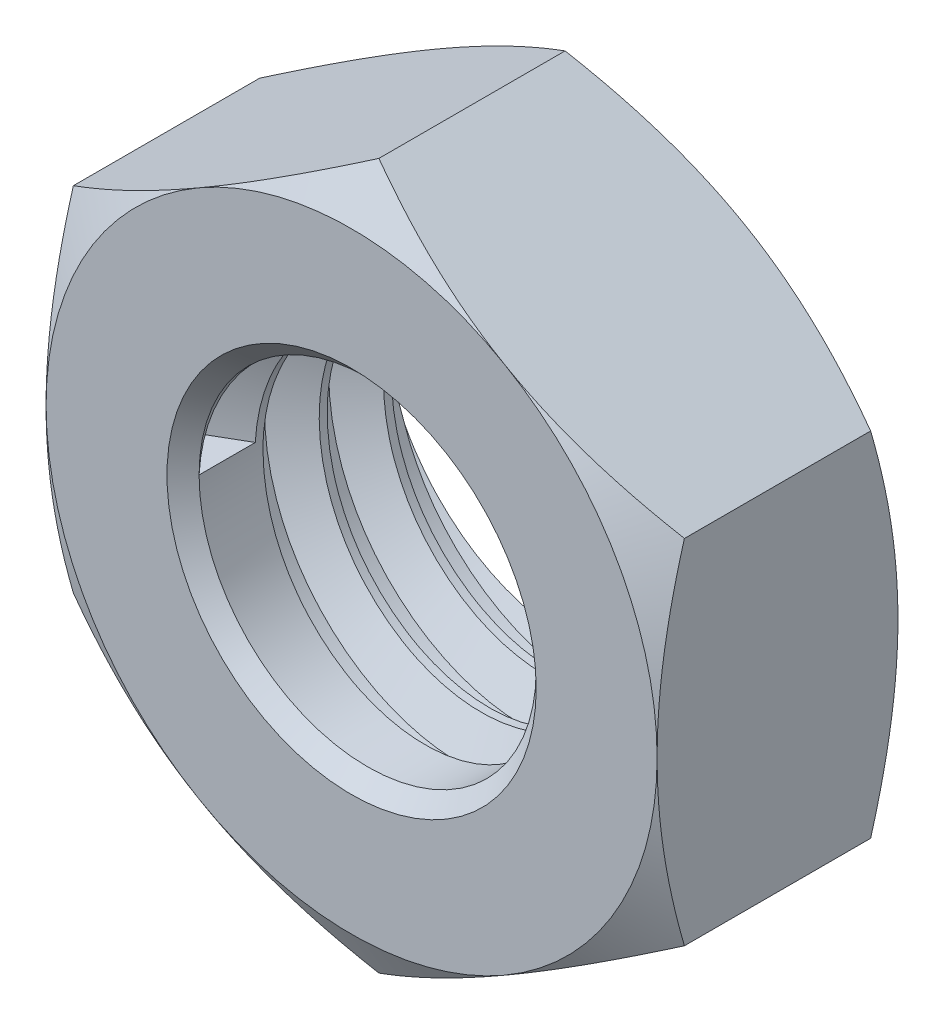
ISO-10303-21;
HEADER;
FILE_DESCRIPTION(('STEP AP214'),'2;1');
FILE_NAME('part.step','',(''),(''),'','','');
FILE_SCHEMA(('AUTOMOTIVE_DESIGN { 1 0 10303 214 1 1 1 1 }'));
ENDSEC;
DATA;
#1=APPLICATION_CONTEXT('core data for automotive mechanical design processes');
#2=APPLICATION_PROTOCOL_DEFINITION('international standard','automotive_design',2000,#1);
#3=PRODUCT_CONTEXT('',#1,'mechanical');
#4=PRODUCT('Part','Part','',(#3));
#5=PRODUCT_RELATED_PRODUCT_CATEGORY('part','',(#4));
#6=PRODUCT_DEFINITION_FORMATION('','',#4);
#7=PRODUCT_DEFINITION_CONTEXT('part definition',#1,'design');
#8=PRODUCT_DEFINITION('design','',#6,#7);
#9=PRODUCT_DEFINITION_SHAPE('','',#8);
#10=(LENGTH_UNIT() NAMED_UNIT(*) SI_UNIT(.MILLI.,.METRE.));
#11=(NAMED_UNIT(*) PLANE_ANGLE_UNIT() SI_UNIT($,.RADIAN.));
#12=(NAMED_UNIT(*) SI_UNIT($,.STERADIAN.) SOLID_ANGLE_UNIT());
#13=UNCERTAINTY_MEASURE_WITH_UNIT(LENGTH_MEASURE(1.E-05),#10,'distance_accuracy_value','');
#14=(GEOMETRIC_REPRESENTATION_CONTEXT(3) GLOBAL_UNCERTAINTY_ASSIGNED_CONTEXT((#13)) GLOBAL_UNIT_ASSIGNED_CONTEXT((#10,
#11,#12)) REPRESENTATION_CONTEXT('',''));
#15=CARTESIAN_POINT('',(0.,0.,0.));
#16=DIRECTION('',(0.,0.,1.));
#17=DIRECTION('',(1.,0.,0.));
#18=AXIS2_PLACEMENT_3D('',#15,#16,#17);
#19=CARTESIAN_POINT('',(0.,0.,0.));
#20=DIRECTION('',(0.,0.,1.));
#21=DIRECTION('',(1.,0.,0.));
#22=AXIS2_PLACEMENT_3D('',#19,#20,#21);
#23=PLANE('',#22);
#24=CARTESIAN_POINT('',(0.,0.,0.));
#25=DIRECTION('',(0.,0.,1.));
#26=DIRECTION('',(1.,0.,0.));
#27=AXIS2_PLACEMENT_3D('',#24,#25,#26);
#28=CIRCLE('',#27,3.80618164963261);
#29=CARTESIAN_POINT('',(3.80618164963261,0.,0.));
#30=VERTEX_POINT('',#29);
#31=CARTESIAN_POINT('',(1.9030908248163,3.29625,0.));
#32=VERTEX_POINT('',#31);
#33=EDGE_CURVE('E382',#30,#32,#28,.T.);
#34=ORIENTED_EDGE('',*,*,#33,.F.);
#35=CARTESIAN_POINT('',(1.9030908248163,-3.29625,0.));
#36=VERTEX_POINT('',#35);
#37=EDGE_CURVE('E402',#36,#30,#28,.T.);
#38=ORIENTED_EDGE('',*,*,#37,.F.);
#39=CARTESIAN_POINT('',(-1.9030908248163,-3.29625,0.));
#40=VERTEX_POINT('',#39);
#41=EDGE_CURVE('E405',#40,#36,#28,.T.);
#42=ORIENTED_EDGE('',*,*,#41,.F.);
#43=CARTESIAN_POINT('',(-3.80618164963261,0.,0.));
#44=VERTEX_POINT('',#43);
#45=EDGE_CURVE('E490',#44,#40,#28,.T.);
#46=ORIENTED_EDGE('',*,*,#45,.F.);
#47=CARTESIAN_POINT('',(0.,0.,0.));
#48=DIRECTION('',(0.,0.,-1.));
#49=DIRECTION('',(-1.,0.,0.));
#50=AXIS2_PLACEMENT_3D('',#47,#48,#49);
#51=CIRCLE('',#50,3.80618164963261);
#52=CARTESIAN_POINT('',(-1.9030908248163,3.29625,0.));
#53=VERTEX_POINT('',#52);
#54=EDGE_CURVE('E459',#44,#53,#51,.T.);
#55=ORIENTED_EDGE('',*,*,#54,.T.);
#56=EDGE_CURVE('E491',#32,#53,#28,.T.);
#57=ORIENTED_EDGE('',*,*,#56,.F.);
#58=EDGE_LOOP('',(#34,#38,#42,#46,#55,#57));
#59=FACE_BOUND('',#58,.T.);
#60=CARTESIAN_POINT('',(1.4849242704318,-1.48492421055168,0.));
#61=CARTESIAN_POINT('',(1.44614451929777,-1.53228096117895,0.));
#62=CARTESIAN_POINT('',(1.40538312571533,-1.57798028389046,0.));
#63=CARTESIAN_POINT('',(1.32015969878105,-1.66578552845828,0.));
#64=CARTESIAN_POINT('',(1.27569772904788,-1.70789151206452,0.));
#65=CARTESIAN_POINT('',(1.13727470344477,-1.82829797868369,0.));
#66=CARTESIAN_POINT('',(1.03817277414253,-1.90081343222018,0.));
#67=CARTESIAN_POINT('',(0.829138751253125,-2.02817265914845,0.));
#68=CARTESIAN_POINT('',(0.719202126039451,-2.0830089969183,0.));
#69=CARTESIAN_POINT('',(0.548717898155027,-2.15080762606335,0.));
#70=CARTESIAN_POINT('',(0.490952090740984,-2.17099953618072,0.));
#71=CARTESIAN_POINT('',(0.373920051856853,-2.20645593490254,0.));
#72=CARTESIAN_POINT('',(0.314653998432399,-2.22172100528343,0.));
#73=CARTESIAN_POINT('',(0.19511915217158,-2.2472002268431,0.));
#74=CARTESIAN_POINT('',(0.13485159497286,-2.25742018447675,0.));
#75=CARTESIAN_POINT('',(0.0136702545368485,-2.27276118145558,0.));
#76=CARTESIAN_POINT('',(-0.0472436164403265,-2.27788151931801,0.));
#77=CARTESIAN_POINT('',(-0.169330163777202,-2.283416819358,0.));
#78=CARTESIAN_POINT('',(-0.230503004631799,-2.28382811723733,0.));
#79=CARTESIAN_POINT('',(-0.352699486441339,-2.27987148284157,0.));
#80=CARTESIAN_POINT('',(-0.413723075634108,-2.27550207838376,0.));
#81=CARTESIAN_POINT('',(-0.602161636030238,-2.2545732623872,-1.1055916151E-13));
#82=CARTESIAN_POINT('',(-0.728778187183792,-2.22989218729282,0.));
#83=CARTESIAN_POINT('',(-0.976075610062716,-2.16022640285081,0.));
#84=CARTESIAN_POINT('',(-1.09676184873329,-2.11526044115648,0.));
#85=CARTESIAN_POINT('',(-1.33250814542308,-2.00467463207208,0.));
#86=CARTESIAN_POINT('',(-1.44731725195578,-1.93851348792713,0.));
#87=CARTESIAN_POINT('',(-1.6099602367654,-1.82558107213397,0.));
#88=CARTESIAN_POINT('',(-1.66263157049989,-1.78560413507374,0.));
#89=CARTESIAN_POINT('',(-1.73900625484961,-1.72245120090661,0.));
#90=CARTESIAN_POINT('',(-1.76402946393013,-1.70086534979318,0.));
#91=CARTESIAN_POINT('',(-1.81322229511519,-1.65674152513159,0.));
#92=CARTESIAN_POINT('',(-1.83739185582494,-1.63420348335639,0.));
#93=CARTESIAN_POINT('',(-1.90926933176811,-1.56448155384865,0.));
#94=CARTESIAN_POINT('',(-1.95557100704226,-1.51583073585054,0.));
#95=CARTESIAN_POINT('',(-2.04414294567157,-1.41500787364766,0.));
#96=CARTESIAN_POINT('',(-2.08641361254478,-1.36283618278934,0.));
#97=CARTESIAN_POINT('',(-2.16657671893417,-1.25540153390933,0.));
#98=CARTESIAN_POINT('',(-2.20447828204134,-1.20014538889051,0.));
#99=CARTESIAN_POINT('',(-2.27577764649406,-1.08678737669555,0.));
#100=CARTESIAN_POINT('',(-2.3091747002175,-1.02868503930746,0.));
#101=CARTESIAN_POINT('',(-2.34019858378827,-0.969342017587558,0.));
#102=B_SPLINE_CURVE_WITH_KNOTS('',3,(#60,#61,#62,#63,#64,#65,#66,#67,#68,#69,#70,#71,#72,#73,
#74,#75,#76,#77,#78,#79,#80,#81,#82,#83,#84,#85,#86,#87,#88,#89,#90,#91,#92,#93,#94,#95,#96,#97,
#98,#99,#100,#101),.UNSPECIFIED.,.F.,.F.,(4,2,2,2,2,2,2,2,2,2,2,2,2,2,2,2,2,2,2,2,4),(0.,
0.18351893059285,0.36703470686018,0.733581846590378,1.10028295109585,1.28368105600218,
1.46705749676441,1.65022239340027,1.83341248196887,2.01674510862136,2.20013420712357,
2.58522536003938,2.96996133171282,3.3654326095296,3.5636002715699,3.66271504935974,
3.7618369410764,3.96308932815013,4.16432154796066,4.36512563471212,4.56596300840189),.UNSPECIFIED.);
#103=CARTESIAN_POINT('',(-0.28730177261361,-2.28198547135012,0.));
#104=VERTEX_POINT('',#103);
#105=CARTESIAN_POINT('',(-2.34019858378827,-0.969342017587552,0.));
#106=VERTEX_POINT('',#105);
#107=EDGE_CURVE('E207',#104,#106,#102,.T.);
#108=ORIENTED_EDGE('',*,*,#107,.F.);
#109=CARTESIAN_POINT('',(0.,0.,0.));
#110=DIRECTION('',(0.,0.,1.));
#111=DIRECTION('',(1.,0.,0.));
#112=AXIS2_PLACEMENT_3D('',#109,#110,#111);
#113=CIRCLE('',#112,2.29999999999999);
#114=CARTESIAN_POINT('',(1.41045433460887,1.8167604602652,0.));
#115=VERTEX_POINT('',#114);
#116=EDGE_CURVE('E239',#104,#115,#113,.T.);
#117=ORIENTED_EDGE('',*,*,#116,.T.);
#118=CARTESIAN_POINT('',(-0.969342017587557,2.34019858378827,0.));
#119=CARTESIAN_POINT('',(-0.901726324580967,2.36138987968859,0.));
#120=CARTESIAN_POINT('',(-0.833213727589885,2.379717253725,0.));
#121=CARTESIAN_POINT('',(-0.694898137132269,2.41054633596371,0.));
#122=CARTESIAN_POINT('',(-0.625095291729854,2.42304870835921,0.));
#123=CARTESIAN_POINT('',(-0.484530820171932,2.44215606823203,0.));
#124=CARTESIAN_POINT('',(-0.413767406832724,2.44874787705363,0.));
#125=CARTESIAN_POINT('',(-0.271925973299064,2.45593782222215,0.));
#126=CARTESIAN_POINT('',(-0.200847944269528,2.45653578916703,0.));
#127=CARTESIAN_POINT('',(-0.0943226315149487,2.45294900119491,0.));
#128=CARTESIAN_POINT('',(-0.0587869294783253,2.45100107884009,0.));
#129=CARTESIAN_POINT('',(0.0121588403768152,2.44558681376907,0.));
#130=CARTESIAN_POINT('',(0.0475689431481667,2.44212093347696,0.));
#131=CARTESIAN_POINT('',(0.153504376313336,2.42930122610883,0.));
#132=CARTESIAN_POINT('',(0.223751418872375,2.41752484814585,0.));
#133=CARTESIAN_POINT('',(0.362778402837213,2.38769125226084,0.));
#134=CARTESIAN_POINT('',(0.431560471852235,2.36964391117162,0.));
#135=CARTESIAN_POINT('',(0.567194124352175,2.32740832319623,0.));
#136=CARTESIAN_POINT('',(0.634045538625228,2.30321953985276,0.));
#137=CARTESIAN_POINT('',(0.823176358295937,2.22488242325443,0.));
#138=CARTESIAN_POINT('',(0.942438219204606,2.16310643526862,0.));
#139=CARTESIAN_POINT('',(1.11203048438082,2.05601561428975,0.));
#140=CARTESIAN_POINT('',(1.16705717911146,2.01787272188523,0.));
#141=CARTESIAN_POINT('',(1.27368337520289,1.9370155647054,0.));
#142=CARTESIAN_POINT('',(1.32528244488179,1.89430072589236,0.));
#143=CARTESIAN_POINT('',(1.42408477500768,1.80512614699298,0.));
#144=CARTESIAN_POINT('',(1.47133107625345,1.75871411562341,0.));
#145=CARTESIAN_POINT('',(1.53912782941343,1.68624699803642,0.));
#146=CARTESIAN_POINT('',(1.56121588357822,1.66161485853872,0.));
#147=CARTESIAN_POINT('',(1.60433267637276,1.61144086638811,0.));
#148=CARTESIAN_POINT('',(1.62536143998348,1.58589903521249,0.));
#149=CARTESIAN_POINT('',(1.6866218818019,1.50791286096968,0.));
#150=CARTESIAN_POINT('',(1.72507955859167,1.45405299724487,0.));
#151=CARTESIAN_POINT('',(1.79693892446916,1.34309606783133,0.));
#152=CARTESIAN_POINT('',(1.8303407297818,1.28599907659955,0.));
#153=CARTESIAN_POINT('',(1.91996635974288,1.11537441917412,0.));
#154=CARTESIAN_POINT('',(1.96910566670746,0.998018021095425,0.));
#155=CARTESIAN_POINT('',(2.04620367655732,0.756566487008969,0.));
#156=CARTESIAN_POINT('',(2.07416209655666,0.632471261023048,0.));
#157=CARTESIAN_POINT('',(2.10248031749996,0.422923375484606,0.));
#158=CARTESIAN_POINT('',(2.10890608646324,0.338247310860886,0.));
#159=CARTESIAN_POINT('',(2.11185651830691,0.168895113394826,0.));
#160=CARTESIAN_POINT('',(2.10840123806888,0.084219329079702,0.));
#161=CARTESIAN_POINT('',(2.09999999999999,0.,0.));
#162=B_SPLINE_CURVE_WITH_KNOTS('',3,(#118,#119,#120,#121,#122,#123,#124,#125,#126,#127,#128,
#129,#130,#131,#132,#133,#134,#135,#136,#137,#138,#139,#140,#141,#142,#143,#144,#145,#146,#147,
#148,#149,#150,#151,#152,#153,#154,#155,#156,#157,#158,#159,#160,#161),.UNSPECIFIED.,.F.,.F.,(4,
2,2,2,2,2,2,2,2,2,2,2,2,2,2,2,2,2,2,2,2,4),(0.,0.212512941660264,0.425001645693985,
0.63796296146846,0.850930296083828,0.957670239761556,1.06437768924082,1.27774299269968,
1.49077375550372,1.70382313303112,2.10443960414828,2.30511500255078,2.50581562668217,
2.70425101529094,2.80348080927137,2.9027082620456,3.10093758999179,3.29916236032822,
3.67877231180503,4.05838733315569,4.31260077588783,4.56629857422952),.UNSPECIFIED.);
#163=CARTESIAN_POINT('',(-0.969342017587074,2.34019858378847,0.));
#164=VERTEX_POINT('',#163);
#165=EDGE_CURVE('E62',#164,#115,#162,.T.);
#166=ORIENTED_EDGE('',*,*,#165,.F.);
#167=CARTESIAN_POINT('',(-2.34019858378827,-0.969342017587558,0.));
#168=CARTESIAN_POINT('',(-2.36580435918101,-0.907522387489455,0.));
#169=CARTESIAN_POINT('',(-2.38894923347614,-0.844715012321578,0.));
#170=CARTESIAN_POINT('',(-2.43023315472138,-0.717365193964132,0.));
#171=CARTESIAN_POINT('',(-2.4483641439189,-0.652820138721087,0.));
#172=CARTESIAN_POINT('',(-2.49534083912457,-0.455806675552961,0.));
#173=CARTESIAN_POINT('',(-2.51619876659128,-0.321338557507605,0.));
#174=CARTESIAN_POINT('',(-2.53614515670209,-0.0507291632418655,0.));
#175=CARTESIAN_POINT('',(-2.53521142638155,0.0854136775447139,0.));
#176=CARTESIAN_POINT('',(-2.51097790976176,0.362503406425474,0.));
#177=CARTESIAN_POINT('',(-2.48657738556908,0.503356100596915,0.));
#178=CARTESIAN_POINT('',(-2.41447681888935,0.778939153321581,0.));
#179=CARTESIAN_POINT('',(-2.36677915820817,0.913670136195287,0.));
#180=CARTESIAN_POINT('',(-2.24945319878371,1.17319647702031,0.));
#181=CARTESIAN_POINT('',(-2.17982803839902,1.29799325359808,0.));
#182=CARTESIAN_POINT('',(-2.02057932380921,1.53417754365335,0.));
#183=CARTESIAN_POINT('',(-1.93094801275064,1.64555983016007,0.));
#184=CARTESIAN_POINT('',(-1.73421269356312,1.85175492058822,0.));
#185=CARTESIAN_POINT('',(-1.62709620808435,1.94655579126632,0.));
#186=CARTESIAN_POINT('',(-1.398558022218,2.11669784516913,0.));
#187=CARTESIAN_POINT('',(-1.27716271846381,2.19207413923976,0.));
#188=CARTESIAN_POINT('',(-1.12084865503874,2.27177627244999,0.));
#189=CARTESIAN_POINT('',(-1.0909031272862,2.28630603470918,0.));
#190=CARTESIAN_POINT('',(-1.03050525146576,2.31415480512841,0.));
#191=CARTESIAN_POINT('',(-1.0000536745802,2.32747548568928,0.));
#192=CARTESIAN_POINT('',(-0.969342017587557,2.34019858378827,0.));
#193=B_SPLINE_CURVE_WITH_KNOTS('',3,(#167,#168,#169,#170,#171,#172,#173,#174,#175,#176,#177,
#178,#179,#180,#181,#182,#183,#184,#185,#186,#187,#188,#189,#190,#191,#192),.UNSPECIFIED.,.F.,
.F.,(4,2,2,2,2,2,2,2,2,2,2,2,4),(0.,0.200627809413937,0.401576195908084,0.807899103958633,
1.21463583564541,1.64143127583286,2.06818309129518,2.49487385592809,2.92173034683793,
3.3488927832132,3.77527759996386,3.87511661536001,3.97481535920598),.UNSPECIFIED.);
#194=EDGE_CURVE('E13',#106,#164,#193,.T.);
#195=ORIENTED_EDGE('',*,*,#194,.F.);
#196=EDGE_LOOP('',(#108,#117,#166,#195));
#197=FACE_BOUND('',#196,.T.);
#198=ADVANCED_FACE('F44',(#59,#197),#23,.F.);
#199=CARTESIAN_POINT('',(0.,0.,0.));
#200=DIRECTION('',(0.,0.,-1.));
#201=DIRECTION('',(-1.,0.,0.));
#202=AXIS2_PLACEMENT_3D('',#199,#200,#201);
#203=CYLINDRICAL_SURFACE('',#202,2.09999999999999);
#204=CARTESIAN_POINT('',(-2.09999999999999,0.,2.09999999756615));
#205=CARTESIAN_POINT('',(-2.09999999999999,0.869848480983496,2.04999999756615));
#206=CARTESIAN_POINT('',(-1.48492424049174,1.48492424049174,1.99999999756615));
#207=CARTESIAN_POINT('',(-0.869848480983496,2.09999999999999,1.94999999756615));
#208=CARTESIAN_POINT('',(0.,2.09999999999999,1.89999999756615));
#209=CARTESIAN_POINT('',(0.869848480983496,2.09999999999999,1.84999999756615));
#210=CARTESIAN_POINT('',(1.48492424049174,1.48492424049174,1.79999999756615));
#211=CARTESIAN_POINT('',(2.09999999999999,0.869848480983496,1.74999999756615));
#212=CARTESIAN_POINT('',(2.09999999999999,0.,1.69999999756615));
#213=CARTESIAN_POINT('',(2.09999999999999,-0.869848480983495,1.64999999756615));
#214=CARTESIAN_POINT('',(1.48492424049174,-1.48492424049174,1.59999999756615));
#215=CARTESIAN_POINT('',(0.869848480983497,-2.09999999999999,1.54999999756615));
#216=CARTESIAN_POINT('',(0.,-2.09999999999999,1.49999999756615));
#217=CARTESIAN_POINT('',(-0.869848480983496,-2.09999999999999,1.44999999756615));
#218=CARTESIAN_POINT('',(-1.48492424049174,-1.48492424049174,1.39999999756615));
#219=CARTESIAN_POINT('',(-2.09999999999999,-0.869848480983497,1.34999999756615));
#220=CARTESIAN_POINT('',(-2.09999999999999,0.,1.29999999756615));
#221=CARTESIAN_POINT('',(-2.09999999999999,0.869848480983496,1.24999999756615));
#222=CARTESIAN_POINT('',(-1.48492424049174,1.48492424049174,1.19999999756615));
#223=CARTESIAN_POINT('',(-0.869848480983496,2.09999999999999,1.14999999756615));
#224=CARTESIAN_POINT('',(0.,2.09999999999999,1.09999999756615));
#225=CARTESIAN_POINT('',(0.869848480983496,2.09999999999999,1.04999999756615));
#226=CARTESIAN_POINT('',(1.48492424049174,1.48492424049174,0.999999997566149));
#227=CARTESIAN_POINT('',(2.09999999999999,0.869848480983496,0.949999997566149));
#228=CARTESIAN_POINT('',(2.09999999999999,0.,0.899999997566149));
#229=CARTESIAN_POINT('',(2.09999999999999,-0.869848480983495,0.849999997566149));
#230=CARTESIAN_POINT('',(1.48492424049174,-1.48492424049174,0.799999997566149));
#231=CARTESIAN_POINT('',(0.869848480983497,-2.09999999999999,0.749999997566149));
#232=CARTESIAN_POINT('',(0.,-2.09999999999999,0.699999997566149));
#233=CARTESIAN_POINT('',(-0.869848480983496,-2.09999999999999,0.649999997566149));
#234=CARTESIAN_POINT('',(-1.48492424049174,-1.48492424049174,0.599999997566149));
#235=CARTESIAN_POINT('',(-2.09999999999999,-0.869848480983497,0.549999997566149));
#236=CARTESIAN_POINT('',(-2.09999999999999,0.,0.499999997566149));
#237=CARTESIAN_POINT('',(-2.09999999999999,0.869848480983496,0.449999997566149));
#238=CARTESIAN_POINT('',(-1.48492424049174,1.48492424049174,0.399999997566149));
#239=CARTESIAN_POINT('',(-0.869848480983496,2.09999999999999,0.349999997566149));
#240=CARTESIAN_POINT('',(0.,2.09999999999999,0.299999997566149));
#241=CARTESIAN_POINT('',(0.869848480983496,2.09999999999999,0.249999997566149));
#242=CARTESIAN_POINT('',(1.48492424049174,1.48492424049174,0.199999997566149));
#243=CARTESIAN_POINT('',(2.09999999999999,0.869848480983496,0.149999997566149));
#244=CARTESIAN_POINT('',(2.09999999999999,0.,0.099999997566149));
#245=CARTESIAN_POINT('',(2.09999999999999,-0.869848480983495,0.0499999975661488));
#246=CARTESIAN_POINT('',(1.48492424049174,-1.48492424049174,-2.43385129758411E-09));
#247=CARTESIAN_POINT('',(0.869848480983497,-2.09999999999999,-0.050000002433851));
#248=CARTESIAN_POINT('',(0.,-2.09999999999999,-0.100000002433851));
#249=CARTESIAN_POINT('',(-0.869848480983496,-2.09999999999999,-0.150000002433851));
#250=CARTESIAN_POINT('',(-1.48492424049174,-1.48492424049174,-0.200000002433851));
#251=CARTESIAN_POINT('',(-2.09999999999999,-0.869848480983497,-0.250000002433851));
#252=CARTESIAN_POINT('',(-2.09999999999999,0.,-0.300000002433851));
#253=CARTESIAN_POINT('',(-2.09999999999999,0.869848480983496,-0.350000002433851));
#254=CARTESIAN_POINT('',(-1.48492424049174,1.48492424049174,-0.400000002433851));
#255=CARTESIAN_POINT('',(-0.869848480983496,2.09999999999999,-0.450000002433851));
#256=CARTESIAN_POINT('',(0.,2.09999999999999,-0.500000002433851));
#257=CARTESIAN_POINT('',(0.869848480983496,2.09999999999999,-0.550000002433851));
#258=CARTESIAN_POINT('',(1.48492424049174,1.48492424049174,-0.600000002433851));
#259=CARTESIAN_POINT('',(2.09999999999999,0.869848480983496,-0.650000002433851));
#260=CARTESIAN_POINT('',(2.09999999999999,0.,-0.700000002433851));
#261=(BOUNDED_CURVE() B_SPLINE_CURVE(2,(#204,#205,#206,#207,#208,#209,#210,#211,#212,#213,#214,
#215,#216,#217,#218,#219,#220,#221,#222,#223,#224,#225,#226,#227,#228,#229,#230,#231,#232,#233,
#234,#235,#236,#237,#238,#239,#240,#241,#242,#243,#244,#245,#246,#247,#248,#249,#250,#251,#252,
#253,#254,#255,#256,#257,#258,#259,#260),.UNSPECIFIED.,.F.,.F.) B_SPLINE_CURVE_WITH_KNOTS((3,2,
2,2,2,2,2,2,2,2,2,2,2,2,2,2,2,2,2,2,2,2,2,2,2,2,2,2,3),(0.,0.03125,0.0625,0.09375,0.125,0.15625,
0.1875,0.21875,0.25,0.28125,0.3125,0.34375,0.375,0.40625,0.4375,0.46875,0.5,0.53125,0.5625,
0.59375,0.625,0.65625,0.6875,0.71875,0.75,0.78125,0.8125,0.84375,0.875),
.UNSPECIFIED.) CURVE() GEOMETRIC_REPRESENTATION_ITEM() RATIONAL_B_SPLINE_CURVE((1.,
0.923879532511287,1.,0.923879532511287,1.,0.923879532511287,1.,0.923879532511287,1.,
0.923879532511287,1.,0.923879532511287,1.,0.923879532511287,1.,0.923879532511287,1.,
0.923879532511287,1.,0.923879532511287,1.,0.923879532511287,1.,0.923879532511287,1.,
0.923879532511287,1.,0.923879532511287,1.,0.923879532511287,1.,0.923879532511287,1.,
0.923879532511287,1.,0.923879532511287,1.,0.923879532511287,1.,0.923879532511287,1.,
0.923879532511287,1.,0.923879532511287,1.,0.923879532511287,1.,0.923879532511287,1.,
0.923879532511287,1.,0.923879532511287,1.,0.923879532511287,1.,0.923879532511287,1.)) REPRESENTATION_ITEM(''));
#262=CARTESIAN_POINT('',(-2.09999999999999,0.,2.09999999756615));
#263=VERTEX_POINT('',#262);
#264=CARTESIAN_POINT('',(1.48492421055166,1.48492427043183,0.200000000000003));
#265=VERTEX_POINT('',#264);
#266=EDGE_CURVE('E175',#263,#265,#261,.T.);
#267=ORIENTED_EDGE('',*,*,#266,.F.);
#268=DIRECTION('',(0.,0.,1.));
#269=VECTOR('',#268,1.);
#270=CARTESIAN_POINT('',(-2.09999999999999,0.,2.44999999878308));
#271=LINE('',#270,#269);
#272=CARTESIAN_POINT('',(-2.09999999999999,0.,2.8));
#273=VERTEX_POINT('',#272);
#274=EDGE_CURVE('E176',#263,#273,#271,.T.);
#275=ORIENTED_EDGE('',*,*,#274,.T.);
#276=CARTESIAN_POINT('',(0.,0.,2.8));
#277=DIRECTION('',(0.,0.,1.));
#278=DIRECTION('',(1.,0.,0.));
#279=AXIS2_PLACEMENT_3D('',#276,#277,#278);
#280=CIRCLE('',#279,2.09999999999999);
#281=EDGE_CURVE('E189',#273,#273,#280,.T.);
#282=ORIENTED_EDGE('',*,*,#281,.T.);
#283=CARTESIAN_POINT('',(-2.09999999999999,0.,2.8));
#284=CARTESIAN_POINT('',(-2.09999999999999,0.869848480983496,2.75));
#285=CARTESIAN_POINT('',(-1.48492424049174,1.48492424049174,2.7));
#286=CARTESIAN_POINT('',(-0.869848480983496,2.09999999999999,2.65));
#287=CARTESIAN_POINT('',(0.,2.09999999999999,2.6));
#288=CARTESIAN_POINT('',(0.869848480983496,2.09999999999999,2.55));
#289=CARTESIAN_POINT('',(1.48492424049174,1.48492424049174,2.5));
#290=CARTESIAN_POINT('',(2.09999999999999,0.869848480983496,2.45));
#291=CARTESIAN_POINT('',(2.09999999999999,0.,2.4));
#292=CARTESIAN_POINT('',(2.09999999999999,-0.869848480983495,2.35));
#293=CARTESIAN_POINT('',(1.48492424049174,-1.48492424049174,2.3));
#294=CARTESIAN_POINT('',(0.869848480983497,-2.09999999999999,2.25));
#295=CARTESIAN_POINT('',(0.,-2.09999999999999,2.2));
#296=CARTESIAN_POINT('',(-0.869848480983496,-2.09999999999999,2.15));
#297=CARTESIAN_POINT('',(-1.48492424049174,-1.48492424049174,2.1));
#298=CARTESIAN_POINT('',(-2.09999999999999,-0.869848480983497,2.05));
#299=CARTESIAN_POINT('',(-2.09999999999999,0.,2.));
#300=CARTESIAN_POINT('',(-2.09999999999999,0.869848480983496,1.95));
#301=CARTESIAN_POINT('',(-1.48492424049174,1.48492424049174,1.9));
#302=CARTESIAN_POINT('',(-0.869848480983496,2.09999999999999,1.85));
#303=CARTESIAN_POINT('',(0.,2.09999999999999,1.8));
#304=CARTESIAN_POINT('',(0.869848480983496,2.09999999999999,1.75));
#305=CARTESIAN_POINT('',(1.48492424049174,1.48492424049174,1.7));
#306=CARTESIAN_POINT('',(2.09999999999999,0.869848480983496,1.65));
#307=CARTESIAN_POINT('',(2.09999999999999,0.,1.6));
#308=CARTESIAN_POINT('',(2.09999999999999,-0.869848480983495,1.55));
#309=CARTESIAN_POINT('',(1.48492424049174,-1.48492424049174,1.5));
#310=CARTESIAN_POINT('',(0.869848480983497,-2.09999999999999,1.45));
#311=CARTESIAN_POINT('',(0.,-2.09999999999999,1.4));
#312=CARTESIAN_POINT('',(-0.869848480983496,-2.09999999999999,1.35));
#313=CARTESIAN_POINT('',(-1.48492424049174,-1.48492424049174,1.3));
#314=CARTESIAN_POINT('',(-2.09999999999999,-0.869848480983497,1.25));
#315=CARTESIAN_POINT('',(-2.09999999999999,0.,1.2));
#316=CARTESIAN_POINT('',(-2.09999999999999,0.869848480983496,1.15));
#317=CARTESIAN_POINT('',(-1.48492424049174,1.48492424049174,1.1));
#318=CARTESIAN_POINT('',(-0.869848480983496,2.09999999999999,1.05));
#319=CARTESIAN_POINT('',(0.,2.09999999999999,1.));
#320=CARTESIAN_POINT('',(0.869848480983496,2.09999999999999,0.950000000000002));
#321=CARTESIAN_POINT('',(1.48492424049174,1.48492424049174,0.900000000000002));
#322=CARTESIAN_POINT('',(2.09999999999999,0.869848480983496,0.850000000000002));
#323=CARTESIAN_POINT('',(2.09999999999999,0.,0.800000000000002));
#324=CARTESIAN_POINT('',(2.09999999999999,-0.869848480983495,0.750000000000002));
#325=CARTESIAN_POINT('',(1.48492424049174,-1.48492424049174,0.700000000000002));
#326=CARTESIAN_POINT('',(0.869848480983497,-2.09999999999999,0.650000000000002));
#327=CARTESIAN_POINT('',(0.,-2.09999999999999,0.600000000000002));
#328=CARTESIAN_POINT('',(-0.869848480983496,-2.09999999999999,0.550000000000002));
#329=CARTESIAN_POINT('',(-1.48492424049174,-1.48492424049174,0.500000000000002));
#330=CARTESIAN_POINT('',(-2.09999999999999,-0.869848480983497,0.450000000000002));
#331=CARTESIAN_POINT('',(-2.09999999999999,0.,0.400000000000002));
#332=CARTESIAN_POINT('',(-2.09999999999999,0.869848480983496,0.350000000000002));
#333=CARTESIAN_POINT('',(-1.48492424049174,1.48492424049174,0.300000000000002));
#334=CARTESIAN_POINT('',(-0.869848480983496,2.09999999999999,0.250000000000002));
#335=CARTESIAN_POINT('',(0.,2.09999999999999,0.200000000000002));
#336=CARTESIAN_POINT('',(0.869848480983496,2.09999999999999,0.150000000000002));
#337=CARTESIAN_POINT('',(1.48492424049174,1.48492424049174,0.100000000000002));
#338=CARTESIAN_POINT('',(2.09999999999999,0.869848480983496,0.0500000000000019));
#339=CARTESIAN_POINT('',(2.09999999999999,0.,0.));
#340=(BOUNDED_CURVE() B_SPLINE_CURVE(2,(#283,#284,#285,#286,#287,#288,#289,#290,#291,#292,#293,
#294,#295,#296,#297,#298,#299,#300,#301,#302,#303,#304,#305,#306,#307,#308,#309,#310,#311,#312,
#313,#314,#315,#316,#317,#318,#319,#320,#321,#322,#323,#324,#325,#326,#327,#328,#329,#330,#331,
#332,#333,#334,#335,#336,#337,#338,#339),.UNSPECIFIED.,.F.,.F.) B_SPLINE_CURVE_WITH_KNOTS((3,2,
2,2,2,2,2,2,2,2,2,2,2,2,2,2,2,2,2,2,2,2,2,2,2,2,2,2,3),(0.,0.03125,0.0625,0.09375,0.125,0.15625,
0.1875,0.21875,0.25,0.28125,0.3125,0.34375,0.375,0.40625,0.4375,0.46875,0.5,0.53125,0.5625,
0.59375,0.625,0.65625,0.6875,0.71875,0.75,0.78125,0.8125,0.84375,0.875),
.UNSPECIFIED.) CURVE() GEOMETRIC_REPRESENTATION_ITEM() RATIONAL_B_SPLINE_CURVE((1.,
0.923879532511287,1.,0.923879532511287,1.,0.923879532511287,1.,0.923879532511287,1.,
0.923879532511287,1.,0.923879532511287,1.,0.923879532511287,1.,0.923879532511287,1.,
0.923879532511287,1.,0.923879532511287,1.,0.923879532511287,1.,0.923879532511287,1.,
0.923879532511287,1.,0.923879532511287,1.,0.923879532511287,1.,0.923879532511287,1.,
0.923879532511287,1.,0.923879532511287,1.,0.923879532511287,1.,0.923879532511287,1.,
0.923879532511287,1.,0.923879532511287,1.,0.923879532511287,1.,0.923879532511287,1.,
0.923879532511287,1.,0.923879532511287,1.,0.923879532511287,1.,0.923879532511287,1.)) REPRESENTATION_ITEM(''));
#341=CARTESIAN_POINT('',(0.,2.09999999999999,0.200000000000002));
#342=VERTEX_POINT('',#341);
#343=EDGE_CURVE('E165',#273,#342,#340,.T.);
#344=ORIENTED_EDGE('',*,*,#343,.T.);
#345=CARTESIAN_POINT('',(0.,0.,0.200000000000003));
#346=DIRECTION('',(0.,0.,1.));
#347=DIRECTION('',(1.,0.,0.));
#348=AXIS2_PLACEMENT_3D('',#345,#346,#347);
#349=CIRCLE('',#348,2.09999999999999);
#350=EDGE_CURVE('E392',#342,#265,#349,.F.);
#351=ORIENTED_EDGE('',*,*,#350,.T.);
#352=EDGE_LOOP('',(#267,#275,#282,#344,#351));
#353=FACE_BOUND('',#352,.T.);
#354=ADVANCED_FACE('F187',(#353),#203,.F.);
#355=CARTESIAN_POINT('',(0.,0.,0.200000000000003));
#356=DIRECTION('',(0.,0.,-1.));
#357=DIRECTION('',(-1.,0.,0.));
#358=AXIS2_PLACEMENT_3D('',#355,#356,#357);
#359=CONICAL_SURFACE('',#358,2.09999999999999,0.785398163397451);
#360=ORIENTED_EDGE('',*,*,#116,.F.);
#361=CARTESIAN_POINT('',(-0.28730177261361,-2.28198547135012,0.));
#362=CARTESIAN_POINT('',(-0.255190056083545,-2.28490152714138,0.00111792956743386));
#363=CARTESIAN_POINT('',(-0.22302160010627,-2.28714593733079,0.00223211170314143));
#364=CARTESIAN_POINT('',(-0.158617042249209,-2.29029289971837,0.00444726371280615));
#365=CARTESIAN_POINT('',(-0.126380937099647,-2.29119538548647,0.00554823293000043));
#366=CARTESIAN_POINT('',(-0.0296560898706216,-2.29189169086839,0.00882219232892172));
#367=CARTESIAN_POINT('',(0.0348605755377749,-2.28967538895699,0.0109666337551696));
#368=CARTESIAN_POINT('',(0.163398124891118,-2.27971616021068,0.0153427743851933));
#369=CARTESIAN_POINT('',(0.227419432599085,-2.27197864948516,0.0175743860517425));
#370=CARTESIAN_POINT('',(0.354547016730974,-2.25106945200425,0.0220912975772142));
#371=CARTESIAN_POINT('',(0.417653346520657,-2.23789808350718,0.0243765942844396));
#372=CARTESIAN_POINT('',(0.604463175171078,-2.1904626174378,0.0312803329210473));
#373=CARTESIAN_POINT('',(0.726235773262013,-2.14823153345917,0.0359663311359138));
#374=CARTESIAN_POINT('',(0.96082061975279,-2.04367735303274,0.0453768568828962));
#375=CARTESIAN_POINT('',(1.07363312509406,-1.98135483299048,0.0501013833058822));
#376=CARTESIAN_POINT('',(1.2330509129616,-1.87465173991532,0.0570802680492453));
#377=CARTESIAN_POINT('',(1.28433273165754,-1.83709306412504,0.0593777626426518));
#378=CARTESIAN_POINT('',(1.38354020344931,-1.75778574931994,0.0639382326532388));
#379=CARTESIAN_POINT('',(1.43146692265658,-1.71603845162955,0.0662012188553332));
#380=CARTESIAN_POINT('',(1.52365529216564,-1.62866302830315,0.0706412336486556));
#381=CARTESIAN_POINT('',(1.56791669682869,-1.58303464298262,0.0728182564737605));
#382=CARTESIAN_POINT('',(1.6523195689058,-1.48813845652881,0.0772350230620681));
#383=CARTESIAN_POINT('',(1.69246134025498,-1.43887092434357,0.0794747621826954));
#384=CARTESIAN_POINT('',(1.80559578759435,-1.28696776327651,0.0862562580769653));
#385=CARTESIAN_POINT('',(1.87214662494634,-1.17942674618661,0.0908991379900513));
#386=CARTESIAN_POINT('',(1.98580725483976,-0.954509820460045,0.100303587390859));
#387=CARTESIAN_POINT('',(2.03291528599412,-0.837133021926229,0.105065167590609));
#388=CARTESIAN_POINT('',(2.08758776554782,-0.657656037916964,0.112143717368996));
#389=CARTESIAN_POINT('',(2.10307012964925,-0.597868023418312,0.114469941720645));
#390=CARTESIAN_POINT('',(2.12894787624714,-0.477182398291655,0.119100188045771));
#391=CARTESIAN_POINT('',(2.1393431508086,-0.416284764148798,0.121404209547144));
#392=CARTESIAN_POINT('',(2.15495281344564,-0.293843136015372,0.125980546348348));
#393=CARTESIAN_POINT('',(2.16016807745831,-0.232299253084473,0.12825286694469));
#394=CARTESIAN_POINT('',(2.16541897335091,-0.108988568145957,0.132717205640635));
#395=CARTESIAN_POINT('',(2.16545473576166,-0.0472217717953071,0.134909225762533));
#396=CARTESIAN_POINT('',(2.16021927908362,0.076131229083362,0.13932015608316));
#397=CARTESIAN_POINT('',(2.15494486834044,0.13771730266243,0.141539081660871));
#398=CARTESIAN_POINT('',(2.1390621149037,0.260176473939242,0.146058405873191));
#399=CARTESIAN_POINT('',(2.12845375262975,0.321049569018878,0.148358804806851));
#400=CARTESIAN_POINT('',(2.08873695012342,0.50194850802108,0.155333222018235));
#401=CARTESIAN_POINT('',(2.0517328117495,0.620346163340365,0.160083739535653));
#402=CARTESIAN_POINT('',(1.9591829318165,0.845568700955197,0.169513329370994));
#403=CARTESIAN_POINT('',(1.90419945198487,0.95262811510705,0.174190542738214));
#404=CARTESIAN_POINT('',(1.77704479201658,1.15589692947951,0.183470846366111));
#405=CARTESIAN_POINT('',(1.70490197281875,1.25212385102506,0.188074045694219));
#406=CARTESIAN_POINT('',(1.60304055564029,1.36651286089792,0.193826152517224));
#407=CARTESIAN_POINT('',(1.580180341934,1.3909926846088,0.195075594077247));
#408=CARTESIAN_POINT('',(1.53336830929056,1.43881029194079,0.197553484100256));
#409=CARTESIAN_POINT('',(1.50941828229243,1.46214982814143,0.198781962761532));
#410=CARTESIAN_POINT('',(1.48492421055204,1.48492427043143,0.199999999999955));
#411=B_SPLINE_CURVE_WITH_KNOTS('',3,(#361,#362,#363,#364,#365,#366,#367,#368,#369,#370,#371,
#372,#373,#374,#375,#376,#377,#378,#379,#380,#381,#382,#383,#384,#385,#386,#387,#388,#389,#390,
#391,#392,#393,#394,#395,#396,#397,#398,#399,#400,#401,#402,#403,#404,#405,#406,#407,#408,#409,
#410),.UNSPECIFIED.,.F.,.F.,(4,2,2,2,2,2,2,2,2,2,2,2,2,2,2,2,2,2,2,2,2,2,2,2,4),(0.,
0.0967740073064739,0.193552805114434,0.387076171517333,0.580409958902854,0.773732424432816,
1.15865894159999,1.54357441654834,1.73420357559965,1.92477188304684,2.11535295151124,
2.30591994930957,2.6835895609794,3.06129337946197,3.24652344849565,3.43175744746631,
3.61696011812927,3.80215812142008,3.98746750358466,4.17277756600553,4.54312446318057,
4.90284889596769,5.26198285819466,5.36251123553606,5.46287990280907),.UNSPECIFIED.);
#412=EDGE_CURVE('E54',#104,#265,#411,.T.);
#413=ORIENTED_EDGE('',*,*,#412,.T.);
#414=ORIENTED_EDGE('',*,*,#350,.F.);
#415=CARTESIAN_POINT('',(0.,2.1,0.199999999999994));
#416=CARTESIAN_POINT('',(0.0626936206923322,2.10852721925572,0.191472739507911));
#417=CARTESIAN_POINT('',(0.125713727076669,2.11434276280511,0.182848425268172));
#418=CARTESIAN_POINT('',(0.251999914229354,2.12052718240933,0.165470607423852));
#419=CARTESIAN_POINT('',(0.315265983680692,2.12089630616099,0.15671710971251));
#420=CARTESIAN_POINT('',(0.501305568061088,2.11393185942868,0.130849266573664));
#421=CARTESIAN_POINT('',(0.623863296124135,2.09899630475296,0.113644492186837));
#422=CARTESIAN_POINT('',(0.859768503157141,2.04986420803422,0.0802027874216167));
#423=CARTESIAN_POINT('',(0.973287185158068,2.01649158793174,0.0639552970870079));
#424=CARTESIAN_POINT('',(1.13990966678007,1.95258700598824,0.0398270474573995));
#425=CARTESIAN_POINT('',(1.19554835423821,1.92856531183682,0.0317197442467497));
#426=CARTESIAN_POINT('',(1.3046877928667,1.87600857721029,0.0157026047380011));
#427=CARTESIAN_POINT('',(1.3581883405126,1.84747310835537,0.00779278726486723));
#428=CARTESIAN_POINT('',(1.41045433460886,1.81676046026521,0.));
#429=B_SPLINE_CURVE_WITH_KNOTS('',3,(#415,#416,#417,#418,#419,#420,#421,#422,#423,#424,#425,
#426,#427,#428),.UNSPECIFIED.,.F.,.F.,(4,2,2,2,2,2,4),(0.,0.191413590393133,0.382818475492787,
0.754948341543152,1.11165536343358,1.29490219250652,1.47816642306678),.UNSPECIFIED.);
#430=EDGE_CURVE('E170',#342,#115,#429,.T.);
#431=ORIENTED_EDGE('',*,*,#430,.T.);
#432=EDGE_LOOP('',(#360,#413,#414,#431));
#433=FACE_BOUND('',#432,.T.);
#434=ADVANCED_FACE('F46',(#433),#359,.F.);
#435=CARTESIAN_POINT('',(0.,-4.395,3.));
#436=DIRECTION('',(-0.5,0.866025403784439,0.));
#437=DIRECTION('',(-0.866025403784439,-0.5,0.));
#438=AXIS2_PLACEMENT_3D('',#435,#436,#437);
#439=PLANE('',#438);
#440=DIRECTION('',(0.,0.,-1.));
#441=VECTOR('',#440,1.);
#442=CARTESIAN_POINT('',(3.80618164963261,-2.1975,3.));
#443=LINE('',#442,#441);
#444=CARTESIAN_POINT('',(3.80618164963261,-2.1975,2.6600455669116));
#445=VERTEX_POINT('',#444);
#446=CARTESIAN_POINT('',(3.80618164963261,-2.1975,0.339954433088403));
#447=VERTEX_POINT('',#446);
#448=EDGE_CURVE('E406',#445,#447,#443,.T.);
#449=ORIENTED_EDGE('',*,*,#448,.F.);
#450=CARTESIAN_POINT('',(3.80638164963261,-2.19738452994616,2.65997889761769));
#451=CARTESIAN_POINT('',(3.63911964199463,-2.29395329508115,2.7157534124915));
#452=CARTESIAN_POINT('',(3.47041383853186,-2.39135563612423,2.76647825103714));
#453=CARTESIAN_POINT('',(3.13008092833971,-2.58784693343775,2.85501885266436));
#454=CARTESIAN_POINT('',(2.95844777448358,-2.68693938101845,2.89280329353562));
#455=CARTESIAN_POINT('',(2.61730853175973,-2.88389621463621,2.95162012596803));
#456=CARTESIAN_POINT('',(2.44785493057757,-2.98173029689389,2.97304397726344));
#457=CARTESIAN_POINT('',(2.10815041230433,-3.17785879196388,2.99861934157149));
#458=CARTESIAN_POINT('',(1.93790072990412,-3.27615249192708,3.0027920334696));
#459=CARTESIAN_POINT('',(1.61978110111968,-3.45981894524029,2.99411025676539));
#460=CARTESIAN_POINT('',(1.47186352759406,-3.54521919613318,2.98338745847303));
#461=CARTESIAN_POINT('',(1.17699206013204,-3.71546331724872,2.94940283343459));
#462=CARTESIAN_POINT('',(1.030039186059,-3.80030659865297,2.92612939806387));
#463=CARTESIAN_POINT('',(0.734559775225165,-3.97090171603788,2.86794774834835));
#464=CARTESIAN_POINT('',(0.586070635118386,-4.05663196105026,2.83279290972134));
#465=CARTESIAN_POINT('',(0.291307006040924,-4.22681382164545,2.75300530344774));
#466=CARTESIAN_POINT('',(0.145028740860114,-4.31126761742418,2.70839128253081));
#467=CARTESIAN_POINT('',(-0.000199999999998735,-4.39511547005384,2.65997889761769));
#468=B_SPLINE_CURVE_WITH_KNOTS('',3,(#450,#451,#452,#453,#454,#455,#456,#457,#458,#459,#460,
#461,#462,#463,#464,#465,#466,#467),.UNSPECIFIED.,.F.,.F.,(4,2,2,2,2,2,2,2,4),(0.,
0.603326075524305,1.20810234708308,1.79791073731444,2.38699481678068,2.89991698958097,
3.41331440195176,3.9380996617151,4.46185443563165),.UNSPECIFIED.);
#469=CARTESIAN_POINT('',(1.9030908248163,-3.29625,3.));
#470=VERTEX_POINT('',#469);
#471=EDGE_CURVE('E669',#445,#470,#468,.T.);
#472=ORIENTED_EDGE('',*,*,#471,.T.);
#473=CARTESIAN_POINT('',(0.,-4.395,2.6600455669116));
#474=VERTEX_POINT('',#473);
#475=EDGE_CURVE('E70',#470,#474,#468,.T.);
#476=ORIENTED_EDGE('',*,*,#475,.T.);
#477=DIRECTION('',(0.,0.,-1.));
#478=VECTOR('',#477,1.);
#479=CARTESIAN_POINT('',(0.,-4.395,3.));
#480=LINE('',#479,#478);
#481=CARTESIAN_POINT('',(0.,-4.395,0.339954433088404));
#482=VERTEX_POINT('',#481);
#483=EDGE_CURVE('E415',#474,#482,#480,.T.);
#484=ORIENTED_EDGE('',*,*,#483,.T.);
#485=CARTESIAN_POINT('',(3.80638164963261,-2.19738452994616,0.340021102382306));
#486=CARTESIAN_POINT('',(3.63911964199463,-2.29395329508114,0.284246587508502));
#487=CARTESIAN_POINT('',(3.47041383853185,-2.39135563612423,0.233521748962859));
#488=CARTESIAN_POINT('',(3.13008092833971,-2.58784693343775,0.144981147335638));
#489=CARTESIAN_POINT('',(2.95844777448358,-2.68693938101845,0.107196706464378));
#490=CARTESIAN_POINT('',(2.61730853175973,-2.88389621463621,0.048379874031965));
#491=CARTESIAN_POINT('',(2.44785493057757,-2.98173029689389,0.026956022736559));
#492=CARTESIAN_POINT('',(2.10815041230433,-3.17785879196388,0.00138065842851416));
#493=CARTESIAN_POINT('',(1.93790072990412,-3.27615249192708,-0.00279203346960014));
#494=CARTESIAN_POINT('',(1.61978110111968,-3.45981894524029,0.00588974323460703));
#495=CARTESIAN_POINT('',(1.47186352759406,-3.54521919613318,0.0166125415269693));
#496=CARTESIAN_POINT('',(1.17699206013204,-3.71546331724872,0.05059716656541));
#497=CARTESIAN_POINT('',(1.030039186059,-3.80030659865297,0.0738706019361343));
#498=CARTESIAN_POINT('',(0.734559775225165,-3.97090171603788,0.132052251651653));
#499=CARTESIAN_POINT('',(0.586070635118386,-4.05663196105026,0.16720709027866));
#500=CARTESIAN_POINT('',(0.291307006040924,-4.22681382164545,0.246994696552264));
#501=CARTESIAN_POINT('',(0.145028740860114,-4.31126761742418,0.29160871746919));
#502=CARTESIAN_POINT('',(-0.000199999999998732,-4.39511547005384,0.340021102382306));
#503=B_SPLINE_CURVE_WITH_KNOTS('',3,(#485,#486,#487,#488,#489,#490,#491,#492,#493,#494,#495,
#496,#497,#498,#499,#500,#501,#502),.UNSPECIFIED.,.F.,.F.,(4,2,2,2,2,2,2,2,4),(0.,
0.603326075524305,1.20810234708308,1.79791073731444,2.38699481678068,2.89991698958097,
3.41331440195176,3.9380996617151,4.46185443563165),.UNSPECIFIED.);
#504=EDGE_CURVE('E335',#36,#482,#503,.T.);
#505=ORIENTED_EDGE('',*,*,#504,.F.);
#506=EDGE_CURVE('E435',#447,#36,#503,.T.);
#507=ORIENTED_EDGE('',*,*,#506,.F.);
#508=EDGE_LOOP('',(#449,#472,#476,#484,#505,#507));
#509=FACE_BOUND('',#508,.T.);
#510=ADVANCED_FACE('F354',(#509),#439,.F.);
#511=CARTESIAN_POINT('',(3.80618164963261,-2.1975,3.));
#512=DIRECTION('',(-1.,0.,0.));
#513=DIRECTION('',(0.,-1.,0.));
#514=AXIS2_PLACEMENT_3D('',#511,#512,#513);
#515=PLANE('',#514);
#516=DIRECTION('',(0.,0.,-1.));
#517=VECTOR('',#516,1.);
#518=CARTESIAN_POINT('',(3.80618164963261,2.1975,3.));
#519=LINE('',#518,#517);
#520=CARTESIAN_POINT('',(3.80618164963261,2.1975,2.6600455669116));
#521=VERTEX_POINT('',#520);
#522=CARTESIAN_POINT('',(3.80618164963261,2.1975,0.339954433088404));
#523=VERTEX_POINT('',#522);
#524=EDGE_CURVE('E408',#521,#523,#519,.T.);
#525=ORIENTED_EDGE('',*,*,#524,.F.);
#526=CARTESIAN_POINT('',(3.80618164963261,-5.98760614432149,1.10122339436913));
#527=CARTESIAN_POINT('',(3.80618164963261,-5.82061366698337,1.18256727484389));
#528=CARTESIAN_POINT('',(3.80618164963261,-5.65324679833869,1.26315528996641));
#529=CARTESIAN_POINT('',(3.80618164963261,-5.31756545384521,1.42239603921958));
#530=CARTESIAN_POINT('',(3.80618164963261,-5.14925084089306,1.5010484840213));
#531=CARTESIAN_POINT('',(3.80618164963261,-4.81064823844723,1.65637216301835));
#532=CARTESIAN_POINT('',(3.80618164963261,-4.64035454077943,1.73303099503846));
#533=CARTESIAN_POINT('',(3.80618164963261,-4.29844181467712,1.88332225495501));
#534=CARTESIAN_POINT('',(3.80618164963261,-4.12682284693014,1.95695482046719));
#535=CARTESIAN_POINT('',(3.80618164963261,-3.77617408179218,2.10281515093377));
#536=CARTESIAN_POINT('',(3.80618164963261,-3.59708948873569,2.17491188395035));
#537=CARTESIAN_POINT('',(3.80618164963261,-3.23685677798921,2.31385139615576));
#538=CARTESIAN_POINT('',(3.80618164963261,-3.0557084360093,2.38069359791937));
#539=CARTESIAN_POINT('',(3.80618164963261,-2.69137233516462,2.50743153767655));
#540=CARTESIAN_POINT('',(3.80618164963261,-2.50818926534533,2.56734062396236));
#541=CARTESIAN_POINT('',(3.80618164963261,-2.13919675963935,2.67834641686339));
#542=CARTESIAN_POINT('',(3.80618164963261,-1.95338814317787,2.72944580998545));
#543=CARTESIAN_POINT('',(3.80618164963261,-1.58006528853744,2.82016577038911));
#544=CARTESIAN_POINT('',(3.80618164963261,-1.39256688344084,2.85985031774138));
#545=CARTESIAN_POINT('',(3.80618164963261,-1.01515221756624,2.92555149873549));
#546=CARTESIAN_POINT('',(3.80618164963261,-0.825236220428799,2.9515696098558));
#547=CARTESIAN_POINT('',(3.80618164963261,-0.446449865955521,2.98752596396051));
#548=CARTESIAN_POINT('',(3.80618164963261,-0.25760027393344,2.99767755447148));
#549=CARTESIAN_POINT('',(3.80618164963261,0.120289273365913,3.00160751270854));
#550=CARTESIAN_POINT('',(3.80618164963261,0.309329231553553,2.99538562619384));
#551=CARTESIAN_POINT('',(3.80618164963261,0.627757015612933,2.97156254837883));
#552=CARTESIAN_POINT('',(3.80618164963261,0.757474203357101,2.95808582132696));
#553=CARTESIAN_POINT('',(3.80618164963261,1.01600851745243,2.92421668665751));
#554=CARTESIAN_POINT('',(3.80618164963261,1.1448255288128,2.90382341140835));
#555=CARTESIAN_POINT('',(3.80618164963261,1.52972347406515,2.83333558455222));
#556=CARTESIAN_POINT('',(3.80618164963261,1.78412347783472,2.77394391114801));
#557=CARTESIAN_POINT('',(3.80618164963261,2.16471920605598,2.67030784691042));
#558=CARTESIAN_POINT('',(3.80618164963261,2.29286875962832,2.63282463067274));
#559=CARTESIAN_POINT('',(3.80618164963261,2.54792433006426,2.55380541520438));
#560=CARTESIAN_POINT('',(3.80618164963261,2.67483033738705,2.51226938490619));
#561=CARTESIAN_POINT('',(3.80618164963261,2.92743742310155,2.42582431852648));
#562=CARTESIAN_POINT('',(3.80618164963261,3.05313883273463,2.380916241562));
#563=CARTESIAN_POINT('',(3.80618164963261,3.30348820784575,2.28827137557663));
#564=CARTESIAN_POINT('',(3.80618164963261,3.42813619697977,2.24053465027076));
#565=CARTESIAN_POINT('',(3.80618164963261,3.7624026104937,2.10886292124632));
#566=CARTESIAN_POINT('',(3.80618164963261,3.97115447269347,2.02273014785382));
#567=CARTESIAN_POINT('',(3.80618164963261,4.38651861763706,1.8454335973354));
#568=CARTESIAN_POINT('',(3.80618164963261,4.59313066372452,1.75426927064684));
#569=CARTESIAN_POINT('',(3.80618164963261,5.00469652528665,1.5680989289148));
#570=CARTESIAN_POINT('',(3.80618164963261,5.20964974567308,1.47309160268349));
#571=CARTESIAN_POINT('',(3.80618164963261,5.61817258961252,1.2801413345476));
#572=CARTESIAN_POINT('',(3.8061816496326,5.82174217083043,1.18219830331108));
#573=CARTESIAN_POINT('',(3.8061816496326,6.22807569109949,0.983865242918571));
#574=CARTESIAN_POINT('',(3.8061816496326,6.4308378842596,0.883471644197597));
#575=CARTESIAN_POINT('',(3.8061816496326,6.83544697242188,0.680854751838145));
#576=CARTESIAN_POINT('',(3.8061816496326,7.03729385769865,0.578631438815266));
#577=CARTESIAN_POINT('',(3.8061816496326,7.64162666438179,0.269819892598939));
#578=CARTESIAN_POINT('',(3.8061816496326,8.04299499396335,0.0610455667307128));
#579=CARTESIAN_POINT('',(3.8061816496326,8.80155322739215,-0.338229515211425));
#580=CARTESIAN_POINT('',(3.8061816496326,9.15894850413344,-0.528341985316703));
#581=CARTESIAN_POINT('',(3.8061816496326,9.87253417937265,-0.910865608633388));
#582=CARTESIAN_POINT('',(3.8061816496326,10.2287245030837,-1.10327690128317));
#583=CARTESIAN_POINT('',(3.8061816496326,10.9389936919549,-1.48915764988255));
#584=CARTESIAN_POINT('',(3.8061816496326,11.2930756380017,-1.68262144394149));
#585=CARTESIAN_POINT('',(3.8061816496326,12.0004871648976,-2.07085483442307));
#586=CARTESIAN_POINT('',(3.8061816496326,12.3538168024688,-2.26562432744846));
#587=CARTESIAN_POINT('',(3.8061816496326,12.7068818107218,-2.46086936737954));
#588=B_SPLINE_CURVE_WITH_KNOTS('',3,(#526,#527,#528,#529,#530,#531,#532,#533,#534,#535,#536,
#537,#538,#539,#540,#541,#542,#543,#544,#545,#546,#547,#548,#549,#550,#551,#552,#553,#554,#555,
#556,#557,#558,#559,#560,#561,#562,#563,#564,#565,#566,#567,#568,#569,#570,#571,#572,#573,#574,
#575,#576,#577,#578,#579,#580,#581,#582,#583,#584,#585,#586,#587),.UNSPECIFIED.,.F.,.F.,(4,2,2,
2,2,2,2,2,2,2,2,2,2,2,2,2,2,2,2,2,2,2,2,2,2,2,2,2,2,2,4),(0.,0.557258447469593,1.1145996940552,
1.67483376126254,2.23504232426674,2.81413575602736,3.39329273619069,3.97131543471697,
4.5491615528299,5.12370275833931,5.69818183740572,6.2648676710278,6.83156230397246,
7.22262041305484,7.61372759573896,8.39632511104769,8.79684552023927,9.19736899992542,
9.59777898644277,9.99817995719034,10.6755516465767,11.3529974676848,12.0306764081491,
12.7083759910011,13.3871298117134,14.0658908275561,15.4231110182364,16.6375436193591,
17.8520502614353,19.0625102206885,20.2728754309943),.UNSPECIFIED.);
#589=CARTESIAN_POINT('',(3.80618164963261,0.,3.));
#590=VERTEX_POINT('',#589);
#591=EDGE_CURVE('E471',#521,#590,#588,.F.);
#592=ORIENTED_EDGE('',*,*,#591,.T.);
#593=EDGE_CURVE('E309',#590,#445,#588,.F.);
#594=ORIENTED_EDGE('',*,*,#593,.T.);
#595=ORIENTED_EDGE('',*,*,#448,.T.);
#596=CARTESIAN_POINT('',(3.80618164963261,-5.98760614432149,1.89877660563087));
#597=CARTESIAN_POINT('',(3.80618164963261,-5.82061366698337,1.8174327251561));
#598=CARTESIAN_POINT('',(3.80618164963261,-5.65324679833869,1.73684471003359));
#599=CARTESIAN_POINT('',(3.80618164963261,-5.31756545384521,1.57760396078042));
#600=CARTESIAN_POINT('',(3.80618164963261,-5.14925084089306,1.49895151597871));
#601=CARTESIAN_POINT('',(3.80618164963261,-4.81064823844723,1.34362783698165));
#602=CARTESIAN_POINT('',(3.80618164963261,-4.64035454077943,1.26696900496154));
#603=CARTESIAN_POINT('',(3.80618164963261,-4.29844181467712,1.11667774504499));
#604=CARTESIAN_POINT('',(3.80618164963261,-4.12682284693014,1.04304517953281));
#605=CARTESIAN_POINT('',(3.80618164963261,-3.77617408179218,0.897184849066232));
#606=CARTESIAN_POINT('',(3.80618164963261,-3.59708948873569,0.825088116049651));
#607=CARTESIAN_POINT('',(3.80618164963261,-3.23685677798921,0.686148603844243));
#608=CARTESIAN_POINT('',(3.80618164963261,-3.0557084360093,0.619306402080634));
#609=CARTESIAN_POINT('',(3.80618164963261,-2.69137233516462,0.49256846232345));
#610=CARTESIAN_POINT('',(3.80618164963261,-2.50818926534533,0.432659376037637));
#611=CARTESIAN_POINT('',(3.80618164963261,-2.13919675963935,0.321653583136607));
#612=CARTESIAN_POINT('',(3.80618164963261,-1.95338814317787,0.270554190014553));
#613=CARTESIAN_POINT('',(3.80618164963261,-1.58006528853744,0.179834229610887));
#614=CARTESIAN_POINT('',(3.80618164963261,-1.39256688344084,0.140149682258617));
#615=CARTESIAN_POINT('',(3.80618164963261,-1.01515221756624,0.0744485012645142));
#616=CARTESIAN_POINT('',(3.80618164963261,-0.825236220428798,0.0484303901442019));
#617=CARTESIAN_POINT('',(3.80618164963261,-0.44644986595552,0.0124740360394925));
#618=CARTESIAN_POINT('',(3.80618164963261,-0.257600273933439,0.00232244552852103));
#619=CARTESIAN_POINT('',(3.80618164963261,0.120289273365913,-0.00160751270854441));
#620=CARTESIAN_POINT('',(3.80618164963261,0.309329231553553,0.00461437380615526));
#621=CARTESIAN_POINT('',(3.80618164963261,0.627757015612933,0.0284374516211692));
#622=CARTESIAN_POINT('',(3.80618164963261,0.757474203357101,0.0419141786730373));
#623=CARTESIAN_POINT('',(3.80618164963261,1.01600851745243,0.0757833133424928));
#624=CARTESIAN_POINT('',(3.80618164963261,1.1448255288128,0.0961765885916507));
#625=CARTESIAN_POINT('',(3.80618164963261,1.52972347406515,0.16666441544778));
#626=CARTESIAN_POINT('',(3.80618164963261,1.78412347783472,0.226056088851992));
#627=CARTESIAN_POINT('',(3.80618164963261,2.16471920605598,0.329692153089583));
#628=CARTESIAN_POINT('',(3.80618164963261,2.29286875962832,0.367175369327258));
#629=CARTESIAN_POINT('',(3.80618164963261,2.54792433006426,0.446194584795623));
#630=CARTESIAN_POINT('',(3.80618164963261,2.67483033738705,0.487730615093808));
#631=CARTESIAN_POINT('',(3.80618164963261,2.92743742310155,0.574175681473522));
#632=CARTESIAN_POINT('',(3.80618164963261,3.05313883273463,0.619083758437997));
#633=CARTESIAN_POINT('',(3.80618164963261,3.30348820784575,0.711728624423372));
#634=CARTESIAN_POINT('',(3.80618164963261,3.42813619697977,0.759465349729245));
#635=CARTESIAN_POINT('',(3.80618164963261,3.7624026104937,0.89113707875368));
#636=CARTESIAN_POINT('',(3.80618164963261,3.97115447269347,0.977269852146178));
#637=CARTESIAN_POINT('',(3.80618164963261,4.38651861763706,1.1545664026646));
#638=CARTESIAN_POINT('',(3.80618164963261,4.59313066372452,1.24573072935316));
#639=CARTESIAN_POINT('',(3.80618164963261,5.00469652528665,1.4319010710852));
#640=CARTESIAN_POINT('',(3.80618164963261,5.20964974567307,1.52690839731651));
#641=CARTESIAN_POINT('',(3.80618164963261,5.61817258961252,1.7198586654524));
#642=CARTESIAN_POINT('',(3.8061816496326,5.82174217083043,1.81780169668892));
#643=CARTESIAN_POINT('',(3.8061816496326,6.22807569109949,2.01613475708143));
#644=CARTESIAN_POINT('',(3.8061816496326,6.4308378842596,2.1165283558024));
#645=CARTESIAN_POINT('',(3.8061816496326,6.83544697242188,2.31914524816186));
#646=CARTESIAN_POINT('',(3.8061816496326,7.03729385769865,2.42136856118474));
#647=CARTESIAN_POINT('',(3.8061816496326,7.64162666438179,2.73018010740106));
#648=CARTESIAN_POINT('',(3.8061816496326,8.04299499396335,2.93895443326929));
#649=CARTESIAN_POINT('',(3.8061816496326,8.80155322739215,3.33822951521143));
#650=CARTESIAN_POINT('',(3.8061816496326,9.15894850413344,3.5283419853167));
#651=CARTESIAN_POINT('',(3.8061816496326,9.87253417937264,3.91086560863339));
#652=CARTESIAN_POINT('',(3.8061816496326,10.2287245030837,4.10327690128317));
#653=CARTESIAN_POINT('',(3.8061816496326,10.9389936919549,4.48915764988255));
#654=CARTESIAN_POINT('',(3.8061816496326,11.2930756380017,4.68262144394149));
#655=CARTESIAN_POINT('',(3.8061816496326,12.0004871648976,5.07085483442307));
#656=CARTESIAN_POINT('',(3.8061816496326,12.3538168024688,5.26562432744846));
#657=CARTESIAN_POINT('',(3.8061816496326,12.7068818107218,5.46086936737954));
#658=B_SPLINE_CURVE_WITH_KNOTS('',3,(#596,#597,#598,#599,#600,#601,#602,#603,#604,#605,#606,
#607,#608,#609,#610,#611,#612,#613,#614,#615,#616,#617,#618,#619,#620,#621,#622,#623,#624,#625,
#626,#627,#628,#629,#630,#631,#632,#633,#634,#635,#636,#637,#638,#639,#640,#641,#642,#643,#644,
#645,#646,#647,#648,#649,#650,#651,#652,#653,#654,#655,#656,#657),.UNSPECIFIED.,.F.,.F.,(4,2,2,
2,2,2,2,2,2,2,2,2,2,2,2,2,2,2,2,2,2,2,2,2,2,2,2,2,2,2,4),(0.,0.557258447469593,1.1145996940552,
1.67483376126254,2.23504232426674,2.81413575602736,3.39329273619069,3.97131543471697,
4.5491615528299,5.12370275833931,5.69818183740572,6.2648676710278,6.83156230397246,
7.22262041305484,7.61372759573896,8.39632511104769,8.79684552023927,9.19736899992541,
9.59777898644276,9.99817995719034,10.6755516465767,11.3529974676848,12.0306764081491,
12.7083759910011,13.3871298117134,14.0658908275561,15.4231110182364,16.6375436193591,
17.8520502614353,19.0625102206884,20.2728754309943),.UNSPECIFIED.);
#659=EDGE_CURVE('E332',#30,#447,#658,.F.);
#660=ORIENTED_EDGE('',*,*,#659,.F.);
#661=EDGE_CURVE('E345',#523,#30,#658,.F.);
#662=ORIENTED_EDGE('',*,*,#661,.F.);
#663=EDGE_LOOP('',(#525,#592,#594,#595,#660,#662));
#664=FACE_BOUND('',#663,.T.);
#665=ADVANCED_FACE('F351',(#664),#515,.F.);
#666=CARTESIAN_POINT('',(3.80618164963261,2.1975,3.));
#667=DIRECTION('',(-0.5,-0.866025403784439,0.));
#668=DIRECTION('',(0.866025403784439,-0.5,0.));
#669=AXIS2_PLACEMENT_3D('',#666,#667,#668);
#670=PLANE('',#669);
#671=DIRECTION('',(0.,0.,-1.));
#672=VECTOR('',#671,1.);
#673=CARTESIAN_POINT('',(0.,4.395,3.));
#674=LINE('',#673,#672);
#675=CARTESIAN_POINT('',(0.,4.395,2.6600455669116));
#676=VERTEX_POINT('',#675);
#677=CARTESIAN_POINT('',(0.,4.395,0.339954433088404));
#678=VERTEX_POINT('',#677);
#679=EDGE_CURVE('E410',#676,#678,#674,.T.);
#680=ORIENTED_EDGE('',*,*,#679,.F.);
#681=CARTESIAN_POINT('',(-0.00019999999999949,4.39511547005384,2.65997889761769));
#682=CARTESIAN_POINT('',(0.167062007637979,4.29854670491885,2.7157534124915));
#683=CARTESIAN_POINT('',(0.335767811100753,4.20114436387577,2.76647825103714));
#684=CARTESIAN_POINT('',(0.676100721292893,4.00465306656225,2.85501885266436));
#685=CARTESIAN_POINT('',(0.847733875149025,3.90556061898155,2.89280329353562));
#686=CARTESIAN_POINT('',(1.18887311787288,3.70860378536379,2.95162012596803));
#687=CARTESIAN_POINT('',(1.35832671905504,3.61076970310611,2.97304397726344));
#688=CARTESIAN_POINT('',(1.69803123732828,3.41464120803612,2.99861934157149));
#689=CARTESIAN_POINT('',(1.86828091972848,3.31634750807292,3.0027920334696));
#690=CARTESIAN_POINT('',(2.18640054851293,3.13268105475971,2.99411025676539));
#691=CARTESIAN_POINT('',(2.33431812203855,3.04728080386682,2.98338745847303));
#692=CARTESIAN_POINT('',(2.62918958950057,2.87703668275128,2.94940283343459));
#693=CARTESIAN_POINT('',(2.77614246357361,2.79219340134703,2.92612939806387));
#694=CARTESIAN_POINT('',(3.07162187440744,2.62159828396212,2.86794774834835));
#695=CARTESIAN_POINT('',(3.22011101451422,2.53586803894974,2.83279290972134));
#696=CARTESIAN_POINT('',(3.51487464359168,2.36568617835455,2.75300530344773));
#697=CARTESIAN_POINT('',(3.66115290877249,2.28123238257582,2.70839128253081));
#698=CARTESIAN_POINT('',(3.80638164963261,2.19738452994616,2.65997889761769));
#699=B_SPLINE_CURVE_WITH_KNOTS('',3,(#681,#682,#683,#684,#685,#686,#687,#688,#689,#690,#691,
#692,#693,#694,#695,#696,#697,#698),.UNSPECIFIED.,.F.,.F.,(4,2,2,2,2,2,2,2,4),(0.,
0.603326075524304,1.20810234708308,1.79791073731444,2.38699481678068,2.89991698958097,
3.41331440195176,3.9380996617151,4.46185443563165),.UNSPECIFIED.);
#700=CARTESIAN_POINT('',(1.9030908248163,3.29625,3.));
#701=VERTEX_POINT('',#700);
#702=EDGE_CURVE('E467',#676,#701,#699,.T.);
#703=ORIENTED_EDGE('',*,*,#702,.T.);
#704=EDGE_CURVE('E276',#701,#521,#699,.T.);
#705=ORIENTED_EDGE('',*,*,#704,.T.);
#706=ORIENTED_EDGE('',*,*,#524,.T.);
#707=CARTESIAN_POINT('',(-0.00019999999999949,4.39511547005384,0.340021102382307));
#708=CARTESIAN_POINT('',(0.16706200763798,4.29854670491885,0.284246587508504));
#709=CARTESIAN_POINT('',(0.335767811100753,4.20114436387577,0.23352174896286));
#710=CARTESIAN_POINT('',(0.676100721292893,4.00465306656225,0.14498114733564));
#711=CARTESIAN_POINT('',(0.847733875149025,3.90556061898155,0.107196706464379));
#712=CARTESIAN_POINT('',(1.18887311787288,3.70860378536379,0.0483798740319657));
#713=CARTESIAN_POINT('',(1.35832671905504,3.61076970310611,0.0269560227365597));
#714=CARTESIAN_POINT('',(1.69803123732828,3.41464120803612,0.00138065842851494));
#715=CARTESIAN_POINT('',(1.86828091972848,3.31634750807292,-0.00279203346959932));
#716=CARTESIAN_POINT('',(2.18640054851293,3.13268105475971,0.00588974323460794));
#717=CARTESIAN_POINT('',(2.33431812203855,3.04728080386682,0.0166125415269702));
#718=CARTESIAN_POINT('',(2.62918958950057,2.87703668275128,0.0505971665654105));
#719=CARTESIAN_POINT('',(2.77614246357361,2.79219340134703,0.0738706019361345));
#720=CARTESIAN_POINT('',(3.07162187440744,2.62159828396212,0.132052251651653));
#721=CARTESIAN_POINT('',(3.22011101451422,2.53586803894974,0.16720709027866));
#722=CARTESIAN_POINT('',(3.51487464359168,2.36568617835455,0.246994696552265));
#723=CARTESIAN_POINT('',(3.66115290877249,2.28123238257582,0.291608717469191));
#724=CARTESIAN_POINT('',(3.80638164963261,2.19738452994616,0.340021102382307));
#725=B_SPLINE_CURVE_WITH_KNOTS('',3,(#707,#708,#709,#710,#711,#712,#713,#714,#715,#716,#717,
#718,#719,#720,#721,#722,#723,#724),.UNSPECIFIED.,.F.,.F.,(4,2,2,2,2,2,2,2,4),(0.,
0.603326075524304,1.20810234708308,1.79791073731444,2.38699481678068,2.89991698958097,
3.41331440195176,3.9380996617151,4.46185443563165),.UNSPECIFIED.);
#726=EDGE_CURVE('E346',#32,#523,#725,.T.);
#727=ORIENTED_EDGE('',*,*,#726,.F.);
#728=EDGE_CURVE('E416',#678,#32,#725,.T.);
#729=ORIENTED_EDGE('',*,*,#728,.F.);
#730=EDGE_LOOP('',(#680,#703,#705,#706,#727,#729));
#731=FACE_BOUND('',#730,.T.);
#732=ADVANCED_FACE('F320',(#731),#670,.F.);
#733=CARTESIAN_POINT('',(0.,4.395,3.));
#734=DIRECTION('',(0.5,-0.866025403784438,0.));
#735=DIRECTION('',(0.866025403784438,0.5,0.));
#736=AXIS2_PLACEMENT_3D('',#733,#734,#735);
#737=PLANE('',#736);
#738=DIRECTION('',(0.,0.,-1.));
#739=VECTOR('',#738,1.);
#740=CARTESIAN_POINT('',(-3.80618164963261,2.1975,3.));
#741=LINE('',#740,#739);
#742=CARTESIAN_POINT('',(-3.80618164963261,2.1975,2.6600455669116));
#743=VERTEX_POINT('',#742);
#744=CARTESIAN_POINT('',(-3.80618164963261,2.1975,0.339954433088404));
#745=VERTEX_POINT('',#744);
#746=EDGE_CURVE('E412',#743,#745,#741,.T.);
#747=ORIENTED_EDGE('',*,*,#746,.F.);
#748=CARTESIAN_POINT('',(-3.80638164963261,2.19738452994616,2.65997889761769));
#749=CARTESIAN_POINT('',(-3.63911964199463,2.29395329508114,2.7157534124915));
#750=CARTESIAN_POINT('',(-3.47041383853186,2.39135563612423,2.76647825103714));
#751=CARTESIAN_POINT('',(-3.13008092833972,2.58784693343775,2.85501885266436));
#752=CARTESIAN_POINT('',(-2.95844777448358,2.68693938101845,2.89280329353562));
#753=CARTESIAN_POINT('',(-2.61730853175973,2.88389621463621,2.95162012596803));
#754=CARTESIAN_POINT('',(-2.44785493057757,2.98173029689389,2.97304397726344));
#755=CARTESIAN_POINT('',(-2.10815041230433,3.17785879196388,2.99861934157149));
#756=CARTESIAN_POINT('',(-1.93790072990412,3.27615249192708,3.0027920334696));
#757=CARTESIAN_POINT('',(-1.61978110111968,3.45981894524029,2.99411025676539));
#758=CARTESIAN_POINT('',(-1.47186352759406,3.54521919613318,2.98338745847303));
#759=CARTESIAN_POINT('',(-1.17699206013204,3.71546331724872,2.94940283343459));
#760=CARTESIAN_POINT('',(-1.030039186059,3.80030659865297,2.92612939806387));
#761=CARTESIAN_POINT('',(-0.734559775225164,3.97090171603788,2.86794774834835));
#762=CARTESIAN_POINT('',(-0.586070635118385,4.05663196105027,2.83279290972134));
#763=CARTESIAN_POINT('',(-0.291307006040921,4.22681382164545,2.75300530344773));
#764=CARTESIAN_POINT('',(-0.145028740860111,4.31126761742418,2.70839128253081));
#765=CARTESIAN_POINT('',(0.000200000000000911,4.39511547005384,2.65997889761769));
#766=B_SPLINE_CURVE_WITH_KNOTS('',3,(#748,#749,#750,#751,#752,#753,#754,#755,#756,#757,#758,
#759,#760,#761,#762,#763,#764,#765),.UNSPECIFIED.,.F.,.F.,(4,2,2,2,2,2,2,2,4),(0.,
0.603326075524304,1.20810234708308,1.79791073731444,2.38699481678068,2.89991698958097,
3.41331440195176,3.9380996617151,4.46185443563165),.UNSPECIFIED.);
#767=CARTESIAN_POINT('',(-1.9030908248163,3.29625,3.));
#768=VERTEX_POINT('',#767);
#769=EDGE_CURVE('E303',#743,#768,#766,.T.);
#770=ORIENTED_EDGE('',*,*,#769,.T.);
#771=EDGE_CURVE('E311',#768,#676,#766,.T.);
#772=ORIENTED_EDGE('',*,*,#771,.T.);
#773=ORIENTED_EDGE('',*,*,#679,.T.);
#774=CARTESIAN_POINT('',(-3.80638164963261,2.19738452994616,0.340021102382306));
#775=CARTESIAN_POINT('',(-3.63911964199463,2.29395329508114,0.284246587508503));
#776=CARTESIAN_POINT('',(-3.47041383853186,2.39135563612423,0.233521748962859));
#777=CARTESIAN_POINT('',(-3.13008092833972,2.58784693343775,0.144981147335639));
#778=CARTESIAN_POINT('',(-2.95844777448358,2.68693938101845,0.107196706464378));
#779=CARTESIAN_POINT('',(-2.61730853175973,2.88389621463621,0.0483798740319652));
#780=CARTESIAN_POINT('',(-2.44785493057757,2.98173029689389,0.0269560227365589));
#781=CARTESIAN_POINT('',(-2.10815041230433,3.17785879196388,0.00138065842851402));
#782=CARTESIAN_POINT('',(-1.93790072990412,3.27615249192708,-0.00279203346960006));
#783=CARTESIAN_POINT('',(-1.61978110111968,3.45981894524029,0.0058897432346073));
#784=CARTESIAN_POINT('',(-1.47186352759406,3.54521919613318,0.0166125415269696));
#785=CARTESIAN_POINT('',(-1.17699206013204,3.71546331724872,0.0505971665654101));
#786=CARTESIAN_POINT('',(-1.030039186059,3.80030659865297,0.0738706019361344));
#787=CARTESIAN_POINT('',(-0.734559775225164,3.97090171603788,0.132052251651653));
#788=CARTESIAN_POINT('',(-0.586070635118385,4.05663196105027,0.16720709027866));
#789=CARTESIAN_POINT('',(-0.291307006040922,4.22681382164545,0.246994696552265));
#790=CARTESIAN_POINT('',(-0.145028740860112,4.31126761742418,0.291608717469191));
#791=CARTESIAN_POINT('',(0.000200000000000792,4.39511547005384,0.340021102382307));
#792=B_SPLINE_CURVE_WITH_KNOTS('',3,(#774,#775,#776,#777,#778,#779,#780,#781,#782,#783,#784,
#785,#786,#787,#788,#789,#790,#791),.UNSPECIFIED.,.F.,.F.,(4,2,2,2,2,2,2,2,4),(0.,
0.603326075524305,1.20810234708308,1.79791073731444,2.38699481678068,2.89991698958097,
3.41331440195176,3.9380996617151,4.46185443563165),.UNSPECIFIED.);
#793=EDGE_CURVE('E334',#53,#678,#792,.T.);
#794=ORIENTED_EDGE('',*,*,#793,.F.);
#795=EDGE_CURVE('E326',#745,#53,#792,.T.);
#796=ORIENTED_EDGE('',*,*,#795,.F.);
#797=EDGE_LOOP('',(#747,#770,#772,#773,#794,#796));
#798=FACE_BOUND('',#797,.T.);
#799=ADVANCED_FACE('F316',(#798),#737,.F.);
#800=CARTESIAN_POINT('',(-3.80618164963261,2.1975,3.));
#801=DIRECTION('',(1.,0.,0.));
#802=DIRECTION('',(0.,1.,0.));
#803=AXIS2_PLACEMENT_3D('',#800,#801,#802);
#804=PLANE('',#803);
#805=DIRECTION('',(0.,0.,-1.));
#806=VECTOR('',#805,1.);
#807=CARTESIAN_POINT('',(-3.80618164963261,-2.1975,3.));
#808=LINE('',#807,#806);
#809=CARTESIAN_POINT('',(-3.80618164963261,-2.1975,2.6600455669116));
#810=VERTEX_POINT('',#809);
#811=CARTESIAN_POINT('',(-3.80618164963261,-2.1975,0.339954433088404));
#812=VERTEX_POINT('',#811);
#813=EDGE_CURVE('E414',#810,#812,#808,.T.);
#814=ORIENTED_EDGE('',*,*,#813,.F.);
#815=CARTESIAN_POINT('',(-3.80618164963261,-5.98760614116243,1.10122339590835));
#816=CARTESIAN_POINT('',(-3.80618164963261,-5.82061366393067,1.18256727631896));
#817=CARTESIAN_POINT('',(-3.80618164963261,-5.65324679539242,1.26315529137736));
#818=CARTESIAN_POINT('',(-3.80618164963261,-5.31756545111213,1.4223960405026));
#819=CARTESIAN_POINT('',(-3.80618164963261,-5.14925083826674,1.50104848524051));
#820=CARTESIAN_POINT('',(-3.80618164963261,-4.81064823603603,1.65637216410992));
#821=CARTESIAN_POINT('',(-3.80618164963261,-4.6403545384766,1.73303099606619));
#822=CARTESIAN_POINT('',(-3.80618164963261,-4.29844181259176,1.88332225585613));
#823=CARTESIAN_POINT('',(-3.80618164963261,-4.12682284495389,1.95695482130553));
#824=CARTESIAN_POINT('',(-3.80618164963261,-3.77617408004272,2.10281515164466));
#825=CARTESIAN_POINT('',(-3.80618164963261,-3.59708948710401,2.17491188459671));
#826=CARTESIAN_POINT('',(-3.80618164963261,-3.23685677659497,2.31385139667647));
#827=CARTESIAN_POINT('',(-3.80618164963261,-3.05570843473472,2.38069359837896));
#828=CARTESIAN_POINT('',(-3.80618164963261,-2.69137233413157,2.50743153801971));
#829=CARTESIAN_POINT('',(-3.80618164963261,-2.50818926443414,2.56734062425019));
#830=CARTESIAN_POINT('',(-3.80618164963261,-2.13919675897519,2.67834641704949));
#831=CARTESIAN_POINT('',(-3.80618164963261,-1.95338814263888,2.72944581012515));
#832=CARTESIAN_POINT('',(-3.80618164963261,-1.58006528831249,2.82016577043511));
#833=CARTESIAN_POINT('',(-3.80618164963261,-1.39256688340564,2.85985031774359));
#834=CARTESIAN_POINT('',(-3.80618164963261,-1.01515221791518,2.92555149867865));
#835=CARTESIAN_POINT('',(-3.80618164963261,-0.825236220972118,2.9515696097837));
#836=CARTESIAN_POINT('',(-3.80618164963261,-0.446449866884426,2.98752596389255));
#837=CARTESIAN_POINT('',(-3.80618164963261,-0.257600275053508,2.9976775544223));
#838=CARTESIAN_POINT('',(-3.80618164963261,0.120289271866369,3.00160751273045));
#839=CARTESIAN_POINT('',(-3.80618164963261,0.309329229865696,2.99538562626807));
#840=CARTESIAN_POINT('',(-3.80618164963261,0.627757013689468,2.97156254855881));
#841=CARTESIAN_POINT('',(-3.80618164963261,0.757474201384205,2.95808582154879));
#842=CARTESIAN_POINT('',(-3.80618164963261,1.01600851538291,2.92421668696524));
#843=CARTESIAN_POINT('',(-3.80618164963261,1.14482552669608,2.90382341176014));
#844=CARTESIAN_POINT('',(-3.80618164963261,1.52972347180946,2.83333558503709));
#845=CARTESIAN_POINT('',(-3.80618164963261,1.78412347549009,2.77394391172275));
#846=CARTESIAN_POINT('',(-3.80618164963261,2.16471920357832,2.67030784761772));
#847=CARTESIAN_POINT('',(-3.80618164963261,2.29286875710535,2.63282463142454));
#848=CARTESIAN_POINT('',(-3.80618164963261,2.54792432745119,2.55380541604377));
#849=CARTESIAN_POINT('',(-3.80618164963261,2.67483033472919,2.51226938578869));
#850=CARTESIAN_POINT('',(-3.80618164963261,2.92743742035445,2.42582431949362));
#851=CARTESIAN_POINT('',(-3.80618164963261,3.05313882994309,2.38091624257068));
#852=CARTESIAN_POINT('',(-3.80618164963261,3.30348820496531,2.28827137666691));
#853=CARTESIAN_POINT('',(-3.80618164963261,3.42813619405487,2.2405346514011));
#854=CARTESIAN_POINT('',(-3.80618164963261,3.76240260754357,2.10886292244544));
#855=CARTESIAN_POINT('',(-3.80618164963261,3.97115446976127,2.02273014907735));
#856=CARTESIAN_POINT('',(-3.80618164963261,4.38651861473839,1.8454335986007));
#857=CARTESIAN_POINT('',(-3.80618164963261,4.59313066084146,1.75426927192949));
#858=CARTESIAN_POINT('',(-3.80618164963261,5.00469652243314,1.56809893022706));
#859=CARTESIAN_POINT('',(-3.80618164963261,5.20964974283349,1.47309160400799));
#860=CARTESIAN_POINT('',(-3.80618164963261,5.61817258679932,1.28014133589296));
#861=CARTESIAN_POINT('',(-3.80618164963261,5.82174216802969,1.18219830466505));
#862=CARTESIAN_POINT('',(-3.80618164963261,6.22807568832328,0.983865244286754));
#863=CARTESIAN_POINT('',(-3.80618164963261,6.43083788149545,0.883471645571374));
#864=CARTESIAN_POINT('',(-3.80618164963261,6.83544696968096,0.680854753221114));
#865=CARTESIAN_POINT('',(-3.80618164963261,7.03729385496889,0.578631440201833));
#866=CARTESIAN_POINT('',(-3.80618164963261,7.64162666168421,0.269819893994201));
#867=CARTESIAN_POINT('',(-3.80618164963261,8.04299499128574,0.0610455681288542));
#868=CARTESIAN_POINT('',(-3.80618164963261,8.80155322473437,-0.338229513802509));
#869=CARTESIAN_POINT('',(-3.80618164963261,9.15894850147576,-0.528341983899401));
#870=CARTESIAN_POINT('',(-3.80618164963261,9.87253417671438,-0.910865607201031));
#871=CARTESIAN_POINT('',(-3.80618164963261,10.2287245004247,-1.10327689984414));
#872=CARTESIAN_POINT('',(-3.80618164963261,10.9389936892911,-1.48915764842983));
#873=CARTESIAN_POINT('',(-3.80618164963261,11.2930756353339,-1.68262144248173));
#874=CARTESIAN_POINT('',(-3.80618164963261,12.0004871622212,-2.07085483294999));
#875=CARTESIAN_POINT('',(-3.80618164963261,12.3538167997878,-2.2656243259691));
#876=CARTESIAN_POINT('',(-3.80618164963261,12.7068818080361,-2.46086936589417));
#877=B_SPLINE_CURVE_WITH_KNOTS('',3,(#815,#816,#817,#818,#819,#820,#821,#822,#823,#824,#825,
#826,#827,#828,#829,#830,#831,#832,#833,#834,#835,#836,#837,#838,#839,#840,#841,#842,#843,#844,
#845,#846,#847,#848,#849,#850,#851,#852,#853,#854,#855,#856,#857,#858,#859,#860,#861,#862,#863,
#864,#865,#866,#867,#868,#869,#870,#871,#872,#873,#874,#875,#876),.UNSPECIFIED.,.F.,.F.,(4,2,2,
2,2,2,2,2,2,2,2,2,2,2,2,2,2,2,2,2,2,2,2,2,2,2,2,2,2,2,4),(0.,0.557258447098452,1.11459969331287,
1.67483376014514,2.23504232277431,2.81413575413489,3.39329273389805,3.97131543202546,
4.54916154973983,5.12370275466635,5.69818183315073,6.26486766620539,6.83156229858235,
7.2226204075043,7.61372759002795,8.39632510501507,8.79684551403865,9.19736899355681,
9.59777897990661,9.99817995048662,10.6755516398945,11.3529974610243,12.030676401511,
12.7083759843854,13.3871298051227,14.0658908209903,15.4231110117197,16.6375436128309,
17.8520502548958,19.0625102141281,20.2728754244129),.UNSPECIFIED.);
#878=CARTESIAN_POINT('',(-3.80618164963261,0.,3.));
#879=VERTEX_POINT('',#878);
#880=EDGE_CURVE('E292',#810,#879,#877,.T.);
#881=ORIENTED_EDGE('',*,*,#880,.T.);
#882=EDGE_CURVE('E310',#879,#743,#877,.T.);
#883=ORIENTED_EDGE('',*,*,#882,.T.);
#884=ORIENTED_EDGE('',*,*,#746,.T.);
#885=CARTESIAN_POINT('',(-3.80618164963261,-5.98760614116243,1.89877660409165));
#886=CARTESIAN_POINT('',(-3.80618164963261,-5.82061366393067,1.81743272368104));
#887=CARTESIAN_POINT('',(-3.80618164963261,-5.65324679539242,1.73684470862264));
#888=CARTESIAN_POINT('',(-3.80618164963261,-5.31756545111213,1.5776039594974));
#889=CARTESIAN_POINT('',(-3.80618164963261,-5.14925083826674,1.49895151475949));
#890=CARTESIAN_POINT('',(-3.80618164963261,-4.81064823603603,1.34362783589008));
#891=CARTESIAN_POINT('',(-3.80618164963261,-4.6403545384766,1.26696900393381));
#892=CARTESIAN_POINT('',(-3.80618164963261,-4.29844181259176,1.11667774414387));
#893=CARTESIAN_POINT('',(-3.80618164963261,-4.12682284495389,1.04304517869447));
#894=CARTESIAN_POINT('',(-3.80618164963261,-3.77617408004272,0.897184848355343));
#895=CARTESIAN_POINT('',(-3.80618164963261,-3.59708948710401,0.825088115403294));
#896=CARTESIAN_POINT('',(-3.80618164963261,-3.23685677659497,0.686148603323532));
#897=CARTESIAN_POINT('',(-3.80618164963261,-3.05570843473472,0.619306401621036));
#898=CARTESIAN_POINT('',(-3.80618164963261,-2.69137233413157,0.492568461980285));
#899=CARTESIAN_POINT('',(-3.80618164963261,-2.50818926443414,0.432659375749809));
#900=CARTESIAN_POINT('',(-3.80618164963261,-2.13919675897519,0.321653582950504));
#901=CARTESIAN_POINT('',(-3.80618164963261,-1.95338814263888,0.270554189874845));
#902=CARTESIAN_POINT('',(-3.80618164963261,-1.58006528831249,0.179834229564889));
#903=CARTESIAN_POINT('',(-3.80618164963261,-1.39256688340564,0.14014968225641));
#904=CARTESIAN_POINT('',(-3.80618164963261,-1.01515221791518,0.074448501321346));
#905=CARTESIAN_POINT('',(-3.80618164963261,-0.825236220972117,0.0484303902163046));
#906=CARTESIAN_POINT('',(-3.80618164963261,-0.446449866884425,0.0124740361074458));
#907=CARTESIAN_POINT('',(-3.80618164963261,-0.257600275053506,0.00232244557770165));
#908=CARTESIAN_POINT('',(-3.80618164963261,0.12028927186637,-0.0016075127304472));
#909=CARTESIAN_POINT('',(-3.80618164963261,0.309329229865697,0.00461437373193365));
#910=CARTESIAN_POINT('',(-3.80618164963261,0.627757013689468,0.0284374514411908));
#911=CARTESIAN_POINT('',(-3.80618164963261,0.757474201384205,0.0419141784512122));
#912=CARTESIAN_POINT('',(-3.80618164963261,1.01600851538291,0.0757833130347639));
#913=CARTESIAN_POINT('',(-3.80618164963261,1.14482552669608,0.0961765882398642));
#914=CARTESIAN_POINT('',(-3.80618164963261,1.52972347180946,0.166664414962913));
#915=CARTESIAN_POINT('',(-3.80618164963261,1.78412347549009,0.226056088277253));
#916=CARTESIAN_POINT('',(-3.80618164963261,2.16471920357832,0.32969215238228));
#917=CARTESIAN_POINT('',(-3.80618164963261,2.29286875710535,0.367175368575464));
#918=CARTESIAN_POINT('',(-3.80618164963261,2.54792432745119,0.446194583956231));
#919=CARTESIAN_POINT('',(-3.80618164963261,2.67483033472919,0.48773061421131));
#920=CARTESIAN_POINT('',(-3.80618164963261,2.92743742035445,0.574175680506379));
#921=CARTESIAN_POINT('',(-3.80618164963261,3.05313882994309,0.61908375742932));
#922=CARTESIAN_POINT('',(-3.80618164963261,3.30348820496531,0.711728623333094));
#923=CARTESIAN_POINT('',(-3.80618164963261,3.42813619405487,0.759465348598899));
#924=CARTESIAN_POINT('',(-3.80618164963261,3.76240260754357,0.891137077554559));
#925=CARTESIAN_POINT('',(-3.80618164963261,3.97115446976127,0.977269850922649));
#926=CARTESIAN_POINT('',(-3.80618164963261,4.38651861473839,1.1545664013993));
#927=CARTESIAN_POINT('',(-3.80618164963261,4.59313066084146,1.24573072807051));
#928=CARTESIAN_POINT('',(-3.80618164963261,5.00469652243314,1.43190106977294));
#929=CARTESIAN_POINT('',(-3.80618164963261,5.20964974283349,1.52690839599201));
#930=CARTESIAN_POINT('',(-3.80618164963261,5.61817258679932,1.71985866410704));
#931=CARTESIAN_POINT('',(-3.80618164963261,5.82174216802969,1.81780169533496));
#932=CARTESIAN_POINT('',(-3.80618164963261,6.22807568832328,2.01613475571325));
#933=CARTESIAN_POINT('',(-3.80618164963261,6.43083788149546,2.11652835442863));
#934=CARTESIAN_POINT('',(-3.80618164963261,6.83544696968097,2.31914524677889));
#935=CARTESIAN_POINT('',(-3.80618164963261,7.0372938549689,2.42136855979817));
#936=CARTESIAN_POINT('',(-3.80618164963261,7.64162666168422,2.7301801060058));
#937=CARTESIAN_POINT('',(-3.80618164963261,8.04299499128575,2.93895443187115));
#938=CARTESIAN_POINT('',(-3.80618164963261,8.80155322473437,3.33822951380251));
#939=CARTESIAN_POINT('',(-3.80618164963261,9.15894850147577,3.52834198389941));
#940=CARTESIAN_POINT('',(-3.80618164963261,9.87253417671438,3.91086560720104));
#941=CARTESIAN_POINT('',(-3.80618164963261,10.2287245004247,4.10327689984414));
#942=CARTESIAN_POINT('',(-3.80618164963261,10.9389936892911,4.48915764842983));
#943=CARTESIAN_POINT('',(-3.80618164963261,11.2930756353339,4.68262144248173));
#944=CARTESIAN_POINT('',(-3.80618164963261,12.0004871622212,5.07085483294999));
#945=CARTESIAN_POINT('',(-3.80618164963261,12.3538167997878,5.2656243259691));
#946=CARTESIAN_POINT('',(-3.80618164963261,12.7068818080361,5.46086936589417));
#947=B_SPLINE_CURVE_WITH_KNOTS('',3,(#885,#886,#887,#888,#889,#890,#891,#892,#893,#894,#895,
#896,#897,#898,#899,#900,#901,#902,#903,#904,#905,#906,#907,#908,#909,#910,#911,#912,#913,#914,
#915,#916,#917,#918,#919,#920,#921,#922,#923,#924,#925,#926,#927,#928,#929,#930,#931,#932,#933,
#934,#935,#936,#937,#938,#939,#940,#941,#942,#943,#944,#945,#946),.UNSPECIFIED.,.F.,.F.,(4,2,2,
2,2,2,2,2,2,2,2,2,2,2,2,2,2,2,2,2,2,2,2,2,2,2,2,2,2,2,4),(0.,0.557258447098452,1.11459969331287,
1.67483376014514,2.23504232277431,2.81413575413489,3.39329273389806,3.97131543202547,
4.54916154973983,5.12370275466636,5.69818183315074,6.26486766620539,6.83156229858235,
7.2226204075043,7.61372759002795,8.39632510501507,8.79684551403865,9.19736899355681,
9.59777897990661,9.99817995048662,10.6755516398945,11.3529974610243,12.030676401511,
12.7083759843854,13.3871298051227,14.0658908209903,15.4231110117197,16.6375436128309,
17.8520502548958,19.0625102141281,20.2728754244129),.UNSPECIFIED.);
#948=EDGE_CURVE('E333',#44,#745,#947,.T.);
#949=ORIENTED_EDGE('',*,*,#948,.F.);
#950=EDGE_CURVE('E442',#812,#44,#947,.T.);
#951=ORIENTED_EDGE('',*,*,#950,.F.);
#952=EDGE_LOOP('',(#814,#881,#883,#884,#949,#951));
#953=FACE_BOUND('',#952,.T.);
#954=ADVANCED_FACE('F319',(#953),#804,.F.);
#955=CARTESIAN_POINT('',(-3.80618164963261,-2.1975,3.));
#956=DIRECTION('',(0.5,0.866025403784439,0.));
#957=DIRECTION('',(-0.866025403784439,0.5,0.));
#958=AXIS2_PLACEMENT_3D('',#955,#956,#957);
#959=PLANE('',#958);
#960=ORIENTED_EDGE('',*,*,#483,.F.);
#961=CARTESIAN_POINT('',(0.00020000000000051,-4.39511547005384,2.65997889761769));
#962=CARTESIAN_POINT('',(-0.167062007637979,-4.29854670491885,2.7157534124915));
#963=CARTESIAN_POINT('',(-0.335767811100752,-4.20114436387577,2.76647825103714));
#964=CARTESIAN_POINT('',(-0.676100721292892,-4.00465306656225,2.85501885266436));
#965=CARTESIAN_POINT('',(-0.847733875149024,-3.90556061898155,2.89280329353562));
#966=CARTESIAN_POINT('',(-1.18887311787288,-3.70860378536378,2.95162012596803));
#967=CARTESIAN_POINT('',(-1.35832671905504,-3.61076970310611,2.97304397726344));
#968=CARTESIAN_POINT('',(-1.69803123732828,-3.41464120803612,2.99861934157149));
#969=CARTESIAN_POINT('',(-1.86828091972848,-3.31634750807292,3.0027920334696));
#970=CARTESIAN_POINT('',(-2.18640054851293,-3.13268105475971,2.99411025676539));
#971=CARTESIAN_POINT('',(-2.33431812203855,-3.04728080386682,2.98338745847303));
#972=CARTESIAN_POINT('',(-2.62918958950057,-2.87703668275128,2.94940283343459));
#973=CARTESIAN_POINT('',(-2.77614246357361,-2.79219340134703,2.92612939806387));
#974=CARTESIAN_POINT('',(-3.07162187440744,-2.62159828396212,2.86794774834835));
#975=CARTESIAN_POINT('',(-3.22011101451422,-2.53586803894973,2.83279290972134));
#976=CARTESIAN_POINT('',(-3.51487464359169,-2.36568617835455,2.75300530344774));
#977=CARTESIAN_POINT('',(-3.66115290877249,-2.28123238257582,2.70839128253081));
#978=CARTESIAN_POINT('',(-3.80638164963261,-2.19738452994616,2.65997889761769));
#979=B_SPLINE_CURVE_WITH_KNOTS('',3,(#961,#962,#963,#964,#965,#966,#967,#968,#969,#970,#971,
#972,#973,#974,#975,#976,#977,#978),.UNSPECIFIED.,.F.,.F.,(4,2,2,2,2,2,2,2,4),(0.,
0.603326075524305,1.20810234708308,1.79791073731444,2.38699481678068,2.89991698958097,
3.41331440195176,3.9380996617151,4.46185443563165),.UNSPECIFIED.);
#980=CARTESIAN_POINT('',(-1.9030908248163,-3.29625,3.));
#981=VERTEX_POINT('',#980);
#982=EDGE_CURVE('E488',#474,#981,#979,.T.);
#983=ORIENTED_EDGE('',*,*,#982,.T.);
#984=EDGE_CURVE('E286',#981,#810,#979,.T.);
#985=ORIENTED_EDGE('',*,*,#984,.T.);
#986=ORIENTED_EDGE('',*,*,#813,.T.);
#987=CARTESIAN_POINT('',(0.00020000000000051,-4.39511547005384,0.340021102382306));
#988=CARTESIAN_POINT('',(-0.167062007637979,-4.29854670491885,0.284246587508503));
#989=CARTESIAN_POINT('',(-0.335767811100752,-4.20114436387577,0.23352174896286));
#990=CARTESIAN_POINT('',(-0.676100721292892,-4.00465306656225,0.144981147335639));
#991=CARTESIAN_POINT('',(-0.847733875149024,-3.90556061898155,0.107196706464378));
#992=CARTESIAN_POINT('',(-1.18887311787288,-3.70860378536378,0.0483798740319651));
#993=CARTESIAN_POINT('',(-1.35832671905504,-3.61076970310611,0.026956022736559));
#994=CARTESIAN_POINT('',(-1.69803123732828,-3.41464120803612,0.00138065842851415));
#995=CARTESIAN_POINT('',(-1.86828091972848,-3.31634750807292,-0.00279203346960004));
#996=CARTESIAN_POINT('',(-2.18640054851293,-3.13268105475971,0.00588974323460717));
#997=CARTESIAN_POINT('',(-2.33431812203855,-3.04728080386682,0.0166125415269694));
#998=CARTESIAN_POINT('',(-2.62918958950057,-2.87703668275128,0.0505971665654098));
#999=CARTESIAN_POINT('',(-2.77614246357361,-2.79219340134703,0.0738706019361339));
#1000=CARTESIAN_POINT('',(-3.07162187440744,-2.62159828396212,0.132052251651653));
#1001=CARTESIAN_POINT('',(-3.22011101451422,-2.53586803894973,0.167207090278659));
#1002=CARTESIAN_POINT('',(-3.51487464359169,-2.36568617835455,0.246994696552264));
#1003=CARTESIAN_POINT('',(-3.66115290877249,-2.28123238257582,0.29160871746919));
#1004=CARTESIAN_POINT('',(-3.80638164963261,-2.19738452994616,0.340021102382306));
#1005=B_SPLINE_CURVE_WITH_KNOTS('',3,(#987,#988,#989,#990,#991,#992,#993,#994,#995,#996,#997,
#998,#999,#1000,#1001,#1002,#1003,#1004),.UNSPECIFIED.,.F.,.F.,(4,2,2,2,2,2,2,2,4),(0.,
0.603326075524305,1.20810234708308,1.79791073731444,2.38699481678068,2.89991698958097,
3.41331440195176,3.9380996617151,4.46185443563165),.UNSPECIFIED.);
#1006=EDGE_CURVE('E448',#40,#812,#1005,.T.);
#1007=ORIENTED_EDGE('',*,*,#1006,.F.);
#1008=EDGE_CURVE('E443',#482,#40,#1005,.T.);
#1009=ORIENTED_EDGE('',*,*,#1008,.F.);
#1010=EDGE_LOOP('',(#960,#983,#985,#986,#1007,#1009));
#1011=FACE_BOUND('',#1010,.T.);
#1012=ADVANCED_FACE('F476',(#1011),#959,.F.);
#1013=CARTESIAN_POINT('',(0.,0.,0.));
#1014=DIRECTION('',(0.,0.,1.));
#1015=DIRECTION('',(-1.,0.,0.));
#1016=AXIS2_PLACEMENT_3D('',#1013,#1014,#1015);
#1017=CONICAL_SURFACE('',#1016,3.80618164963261,1.0471975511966);
#1018=ORIENTED_EDGE('',*,*,#659,.T.);
#1019=ORIENTED_EDGE('',*,*,#506,.T.);
#1020=ORIENTED_EDGE('',*,*,#37,.T.);
#1021=EDGE_LOOP('',(#1018,#1019,#1020));
#1022=FACE_BOUND('',#1021,.T.);
#1023=ADVANCED_FACE('F433',(#1022),#1017,.T.);
#1024=ORIENTED_EDGE('',*,*,#504,.T.);
#1025=ORIENTED_EDGE('',*,*,#1008,.T.);
#1026=ORIENTED_EDGE('',*,*,#41,.T.);
#1027=EDGE_LOOP('',(#1024,#1025,#1026));
#1028=FACE_BOUND('',#1027,.T.);
#1029=ADVANCED_FACE('F485',(#1028),#1017,.T.);
#1030=ORIENTED_EDGE('',*,*,#950,.T.);
#1031=ORIENTED_EDGE('',*,*,#45,.T.);
#1032=ORIENTED_EDGE('',*,*,#1006,.T.);
#1033=EDGE_LOOP('',(#1030,#1031,#1032));
#1034=FACE_BOUND('',#1033,.T.);
#1035=ADVANCED_FACE('F493',(#1034),#1017,.T.);
#1036=ORIENTED_EDGE('',*,*,#795,.T.);
#1037=ORIENTED_EDGE('',*,*,#54,.F.);
#1038=ORIENTED_EDGE('',*,*,#948,.T.);
#1039=EDGE_LOOP('',(#1036,#1037,#1038));
#1040=FACE_BOUND('',#1039,.T.);
#1041=ADVANCED_FACE('F457',(#1040),#1017,.T.);
#1042=ORIENTED_EDGE('',*,*,#728,.T.);
#1043=ORIENTED_EDGE('',*,*,#56,.T.);
#1044=ORIENTED_EDGE('',*,*,#793,.T.);
#1045=EDGE_LOOP('',(#1042,#1043,#1044));
#1046=FACE_BOUND('',#1045,.T.);
#1047=ADVANCED_FACE('F271',(#1046),#1017,.T.);
#1048=ORIENTED_EDGE('',*,*,#726,.T.);
#1049=ORIENTED_EDGE('',*,*,#661,.T.);
#1050=ORIENTED_EDGE('',*,*,#33,.T.);
#1051=EDGE_LOOP('',(#1048,#1049,#1050));
#1052=FACE_BOUND('',#1051,.T.);
#1053=ADVANCED_FACE('F429',(#1052),#1017,.T.);
#1054=CARTESIAN_POINT('',(0.,0.,3.));
#1055=DIRECTION('',(0.,0.,-1.));
#1056=DIRECTION('',(-1.,0.,0.));
#1057=AXIS2_PLACEMENT_3D('',#1054,#1055,#1056);
#1058=CONICAL_SURFACE('',#1057,3.80618164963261,1.0471975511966);
#1059=CARTESIAN_POINT('',(0.,0.,3.));
#1060=DIRECTION('',(0.,0.,1.));
#1061=DIRECTION('',(1.,0.,0.));
#1062=AXIS2_PLACEMENT_3D('',#1059,#1060,#1061);
#1063=CIRCLE('',#1062,3.80618164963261);
#1064=EDGE_CURVE('E398',#701,#590,#1063,.F.);
#1065=ORIENTED_EDGE('',*,*,#1064,.T.);
#1066=ORIENTED_EDGE('',*,*,#591,.F.);
#1067=ORIENTED_EDGE('',*,*,#704,.F.);
#1068=EDGE_LOOP('',(#1065,#1066,#1067));
#1069=FACE_BOUND('',#1068,.T.);
#1070=ADVANCED_FACE('F268',(#1069),#1058,.T.);
#1071=ORIENTED_EDGE('',*,*,#771,.F.);
#1072=EDGE_CURVE('E401',#768,#701,#1063,.F.);
#1073=ORIENTED_EDGE('',*,*,#1072,.T.);
#1074=ORIENTED_EDGE('',*,*,#702,.F.);
#1075=EDGE_LOOP('',(#1071,#1073,#1074));
#1076=FACE_BOUND('',#1075,.T.);
#1077=ADVANCED_FACE('F263',(#1076),#1058,.T.);
#1078=ORIENTED_EDGE('',*,*,#882,.F.);
#1079=CARTESIAN_POINT('',(0.,0.,3.));
#1080=DIRECTION('',(0.,0.,-1.));
#1081=DIRECTION('',(-1.,0.,0.));
#1082=AXIS2_PLACEMENT_3D('',#1079,#1080,#1081);
#1083=CIRCLE('',#1082,3.80618164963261);
#1084=EDGE_CURVE('E390',#879,#768,#1083,.T.);
#1085=ORIENTED_EDGE('',*,*,#1084,.T.);
#1086=ORIENTED_EDGE('',*,*,#769,.F.);
#1087=EDGE_LOOP('',(#1078,#1085,#1086));
#1088=FACE_BOUND('',#1087,.T.);
#1089=ADVANCED_FACE('F267',(#1088),#1058,.T.);
#1090=ORIENTED_EDGE('',*,*,#984,.F.);
#1091=EDGE_CURVE('E676',#981,#879,#1063,.F.);
#1092=ORIENTED_EDGE('',*,*,#1091,.T.);
#1093=ORIENTED_EDGE('',*,*,#880,.F.);
#1094=EDGE_LOOP('',(#1090,#1092,#1093));
#1095=FACE_BOUND('',#1094,.T.);
#1096=ADVANCED_FACE('F270',(#1095),#1058,.T.);
#1097=EDGE_CURVE('E672',#470,#981,#1063,.F.);
#1098=ORIENTED_EDGE('',*,*,#1097,.T.);
#1099=ORIENTED_EDGE('',*,*,#982,.F.);
#1100=ORIENTED_EDGE('',*,*,#475,.F.);
#1101=EDGE_LOOP('',(#1098,#1099,#1100));
#1102=FACE_BOUND('',#1101,.T.);
#1103=ADVANCED_FACE('F561',(#1102),#1058,.T.);
#1104=EDGE_CURVE('E395',#590,#470,#1063,.F.);
#1105=ORIENTED_EDGE('',*,*,#1104,.T.);
#1106=ORIENTED_EDGE('',*,*,#471,.F.);
#1107=ORIENTED_EDGE('',*,*,#593,.F.);
#1108=EDGE_LOOP('',(#1105,#1106,#1107));
#1109=FACE_BOUND('',#1108,.T.);
#1110=ADVANCED_FACE('F370',(#1109),#1058,.T.);
#1111=CARTESIAN_POINT('',(0.,0.,3.));
#1112=DIRECTION('',(0.,0.,1.));
#1113=DIRECTION('',(1.,0.,0.));
#1114=AXIS2_PLACEMENT_3D('',#1111,#1112,#1113);
#1115=PLANE('',#1114);
#1116=CARTESIAN_POINT('',(0.,0.,3.));
#1117=DIRECTION('',(0.,0.,1.));
#1118=DIRECTION('',(1.,0.,0.));
#1119=AXIS2_PLACEMENT_3D('',#1116,#1117,#1118);
#1120=CIRCLE('',#1119,2.29999999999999);
#1121=CARTESIAN_POINT('',(2.29999999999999,0.,3.));
#1122=VERTEX_POINT('',#1121);
#1123=EDGE_CURVE('E393',#1122,#1122,#1120,.F.);
#1124=ORIENTED_EDGE('',*,*,#1123,.T.);
#1125=EDGE_LOOP('',(#1124));
#1126=FACE_BOUND('',#1125,.T.);
#1127=ORIENTED_EDGE('',*,*,#1104,.F.);
#1128=ORIENTED_EDGE('',*,*,#1064,.F.);
#1129=ORIENTED_EDGE('',*,*,#1072,.F.);
#1130=ORIENTED_EDGE('',*,*,#1084,.F.);
#1131=ORIENTED_EDGE('',*,*,#1091,.F.);
#1132=ORIENTED_EDGE('',*,*,#1097,.F.);
#1133=EDGE_LOOP('',(#1127,#1128,#1129,#1130,#1131,#1132));
#1134=FACE_BOUND('',#1133,.T.);
#1135=ADVANCED_FACE('F363',(#1126,#1134),#1115,.T.);
#1136=CARTESIAN_POINT('',(0.,0.,3.));
#1137=DIRECTION('',(0.,0.,1.));
#1138=DIRECTION('',(1.,0.,0.));
#1139=AXIS2_PLACEMENT_3D('',#1136,#1137,#1138);
#1140=CONICAL_SURFACE('',#1139,2.29999999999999,0.785398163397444);
#1141=ORIENTED_EDGE('',*,*,#281,.F.);
#1142=EDGE_LOOP('',(#1141));
#1143=FACE_BOUND('',#1142,.T.);
#1144=ORIENTED_EDGE('',*,*,#1123,.F.);
#1145=EDGE_LOOP('',(#1144));
#1146=FACE_BOUND('',#1145,.T.);
#1147=ADVANCED_FACE('F360',(#1143,#1146),#1140,.F.);
#1148=CARTESIAN_POINT('',(-2.53301270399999,0.,2.54999999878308));
#1149=CARTESIAN_POINT('',(-2.53301270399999,1.04920821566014,2.49999999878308));
#1150=CARTESIAN_POINT('',(-1.79111045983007,1.79111045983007,2.44999999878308));
#1151=CARTESIAN_POINT('',(-1.04920821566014,2.53301270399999,2.39999999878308));
#1152=CARTESIAN_POINT('',(0.,2.53301270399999,2.34999999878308));
#1153=CARTESIAN_POINT('',(1.04920821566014,2.53301270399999,2.29999999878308));
#1154=CARTESIAN_POINT('',(1.79111045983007,1.79111045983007,2.24999999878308));
#1155=CARTESIAN_POINT('',(2.53301270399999,1.04920821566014,2.19999999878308));
#1156=CARTESIAN_POINT('',(2.53301270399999,0.,2.14999999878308));
#1157=CARTESIAN_POINT('',(2.53301270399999,-1.04920821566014,2.09999999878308));
#1158=CARTESIAN_POINT('',(1.79111045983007,-1.79111045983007,2.04999999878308));
#1159=CARTESIAN_POINT('',(1.04920821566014,-2.53301270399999,1.99999999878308));
#1160=CARTESIAN_POINT('',(0.,-2.53301270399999,1.94999999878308));
#1161=CARTESIAN_POINT('',(-1.04920821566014,-2.53301270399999,1.89999999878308));
#1162=CARTESIAN_POINT('',(-1.79111045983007,-1.79111045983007,1.84999999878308));
#1163=CARTESIAN_POINT('',(-2.53301270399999,-1.04920821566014,1.79999999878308));
#1164=CARTESIAN_POINT('',(-2.53301270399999,0.,1.74999999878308));
#1165=CARTESIAN_POINT('',(-2.53301270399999,1.04920821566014,1.69999999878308));
#1166=CARTESIAN_POINT('',(-1.79111045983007,1.79111045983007,1.64999999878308));
#1167=CARTESIAN_POINT('',(-1.04920821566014,2.53301270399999,1.59999999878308));
#1168=CARTESIAN_POINT('',(0.,2.53301270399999,1.54999999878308));
#1169=CARTESIAN_POINT('',(1.04920821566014,2.53301270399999,1.49999999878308));
#1170=CARTESIAN_POINT('',(1.79111045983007,1.79111045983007,1.44999999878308));
#1171=CARTESIAN_POINT('',(2.53301270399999,1.04920821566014,1.39999999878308));
#1172=CARTESIAN_POINT('',(2.53301270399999,0.,1.34999999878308));
#1173=CARTESIAN_POINT('',(2.53301270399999,-1.04920821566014,1.29999999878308));
#1174=CARTESIAN_POINT('',(1.79111045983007,-1.79111045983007,1.24999999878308));
#1175=CARTESIAN_POINT('',(1.04920821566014,-2.53301270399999,1.19999999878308));
#1176=CARTESIAN_POINT('',(0.,-2.53301270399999,1.14999999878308));
#1177=CARTESIAN_POINT('',(-1.04920821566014,-2.53301270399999,1.09999999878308));
#1178=CARTESIAN_POINT('',(-1.79111045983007,-1.79111045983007,1.04999999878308));
#1179=CARTESIAN_POINT('',(-2.53301270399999,-1.04920821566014,0.999999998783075));
#1180=CARTESIAN_POINT('',(-2.53301270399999,0.,0.949999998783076));
#1181=CARTESIAN_POINT('',(-2.53301270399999,1.04920821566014,0.899999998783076));
#1182=CARTESIAN_POINT('',(-1.79111045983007,1.79111045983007,0.849999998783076));
#1183=CARTESIAN_POINT('',(-1.04920821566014,2.53301270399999,0.799999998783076));
#1184=CARTESIAN_POINT('',(0.,2.53301270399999,0.749999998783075));
#1185=CARTESIAN_POINT('',(1.04920821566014,2.53301270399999,0.699999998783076));
#1186=CARTESIAN_POINT('',(1.79111045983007,1.79111045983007,0.649999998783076));
#1187=CARTESIAN_POINT('',(2.53301270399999,1.04920821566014,0.599999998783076));
#1188=CARTESIAN_POINT('',(2.53301270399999,0.,0.549999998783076));
#1189=CARTESIAN_POINT('',(2.53301270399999,-1.04920821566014,0.499999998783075));
#1190=CARTESIAN_POINT('',(1.79111045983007,-1.79111045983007,0.449999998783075));
#1191=CARTESIAN_POINT('',(1.04920821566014,-2.53301270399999,0.399999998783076));
#1192=CARTESIAN_POINT('',(0.,-2.53301270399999,0.349999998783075));
#1193=CARTESIAN_POINT('',(-1.04920821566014,-2.53301270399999,0.299999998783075));
#1194=CARTESIAN_POINT('',(-1.79111045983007,-1.79111045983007,0.249999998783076));
#1195=CARTESIAN_POINT('',(-2.53301270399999,-1.04920821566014,0.199999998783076));
#1196=CARTESIAN_POINT('',(-2.53301270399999,0.,0.149999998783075));
#1197=CARTESIAN_POINT('',(-2.53301270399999,1.04920821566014,0.0999999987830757));
#1198=CARTESIAN_POINT('',(-1.79111045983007,1.79111045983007,0.0499999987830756));
#1199=CARTESIAN_POINT('',(-1.04920821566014,2.53301270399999,-1.21692456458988E-09));
#1200=CARTESIAN_POINT('',(0.,2.53301270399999,-0.0500000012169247));
#1201=CARTESIAN_POINT('',(1.04920821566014,2.53301270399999,-0.100000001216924));
#1202=CARTESIAN_POINT('',(1.79111045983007,1.79111045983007,-0.150000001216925));
#1203=CARTESIAN_POINT('',(2.53301270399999,1.04920821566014,-0.200000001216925));
#1204=CARTESIAN_POINT('',(2.53301270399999,0.,-0.250000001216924));
#1205=CARTESIAN_POINT('',(-2.53301270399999,0.,2.34999999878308));
#1206=CARTESIAN_POINT('',(-2.53301270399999,1.04920821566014,2.29999999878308));
#1207=CARTESIAN_POINT('',(-1.79111045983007,1.79111045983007,2.24999999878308));
#1208=CARTESIAN_POINT('',(-1.04920821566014,2.53301270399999,2.19999999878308));
#1209=CARTESIAN_POINT('',(0.,2.53301270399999,2.14999999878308));
#1210=CARTESIAN_POINT('',(1.04920821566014,2.53301270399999,2.09999999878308));
#1211=CARTESIAN_POINT('',(1.79111045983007,1.79111045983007,2.04999999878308));
#1212=CARTESIAN_POINT('',(2.53301270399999,1.04920821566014,1.99999999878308));
#1213=CARTESIAN_POINT('',(2.53301270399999,0.,1.94999999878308));
#1214=CARTESIAN_POINT('',(2.53301270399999,-1.04920821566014,1.89999999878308));
#1215=CARTESIAN_POINT('',(1.79111045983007,-1.79111045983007,1.84999999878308));
#1216=CARTESIAN_POINT('',(1.04920821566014,-2.53301270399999,1.79999999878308));
#1217=CARTESIAN_POINT('',(0.,-2.53301270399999,1.74999999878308));
#1218=CARTESIAN_POINT('',(-1.04920821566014,-2.53301270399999,1.69999999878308));
#1219=CARTESIAN_POINT('',(-1.79111045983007,-1.79111045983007,1.64999999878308));
#1220=CARTESIAN_POINT('',(-2.53301270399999,-1.04920821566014,1.59999999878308));
#1221=CARTESIAN_POINT('',(-2.53301270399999,0.,1.54999999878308));
#1222=CARTESIAN_POINT('',(-2.53301270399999,1.04920821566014,1.49999999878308));
#1223=CARTESIAN_POINT('',(-1.79111045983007,1.79111045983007,1.44999999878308));
#1224=CARTESIAN_POINT('',(-1.04920821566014,2.53301270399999,1.39999999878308));
#1225=CARTESIAN_POINT('',(0.,2.53301270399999,1.34999999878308));
#1226=CARTESIAN_POINT('',(1.04920821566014,2.53301270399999,1.29999999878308));
#1227=CARTESIAN_POINT('',(1.79111045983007,1.79111045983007,1.24999999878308));
#1228=CARTESIAN_POINT('',(2.53301270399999,1.04920821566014,1.19999999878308));
#1229=CARTESIAN_POINT('',(2.53301270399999,0.,1.14999999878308));
#1230=CARTESIAN_POINT('',(2.53301270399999,-1.04920821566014,1.09999999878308));
#1231=CARTESIAN_POINT('',(1.79111045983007,-1.79111045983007,1.04999999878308));
#1232=CARTESIAN_POINT('',(1.04920821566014,-2.53301270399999,0.999999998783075));
#1233=CARTESIAN_POINT('',(0.,-2.53301270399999,0.949999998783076));
#1234=CARTESIAN_POINT('',(-1.04920821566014,-2.53301270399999,0.899999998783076));
#1235=CARTESIAN_POINT('',(-1.79111045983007,-1.79111045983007,0.849999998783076));
#1236=CARTESIAN_POINT('',(-2.53301270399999,-1.04920821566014,0.799999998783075));
#1237=CARTESIAN_POINT('',(-2.53301270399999,0.,0.749999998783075));
#1238=CARTESIAN_POINT('',(-2.53301270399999,1.04920821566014,0.699999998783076));
#1239=CARTESIAN_POINT('',(-1.79111045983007,1.79111045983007,0.649999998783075));
#1240=CARTESIAN_POINT('',(-1.04920821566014,2.53301270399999,0.599999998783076));
#1241=CARTESIAN_POINT('',(0.,2.53301270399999,0.549999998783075));
#1242=CARTESIAN_POINT('',(1.04920821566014,2.53301270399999,0.499999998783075));
#1243=CARTESIAN_POINT('',(1.79111045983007,1.79111045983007,0.449999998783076));
#1244=CARTESIAN_POINT('',(2.53301270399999,1.04920821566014,0.399999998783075));
#1245=CARTESIAN_POINT('',(2.53301270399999,0.,0.349999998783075));
#1246=CARTESIAN_POINT('',(2.53301270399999,-1.04920821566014,0.299999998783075));
#1247=CARTESIAN_POINT('',(1.79111045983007,-1.79111045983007,0.249999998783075));
#1248=CARTESIAN_POINT('',(1.04920821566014,-2.53301270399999,0.199999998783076));
#1249=CARTESIAN_POINT('',(0.,-2.53301270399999,0.149999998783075));
#1250=CARTESIAN_POINT('',(-1.04920821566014,-2.53301270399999,0.0999999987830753));
#1251=CARTESIAN_POINT('',(-1.79111045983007,-1.79111045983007,0.0499999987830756));
#1252=CARTESIAN_POINT('',(-2.53301270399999,-1.04920821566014,-1.21692456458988E-09));
#1253=CARTESIAN_POINT('',(-2.53301270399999,0.,-0.0500000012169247));
#1254=CARTESIAN_POINT('',(-2.53301270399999,1.04920821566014,-0.100000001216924));
#1255=CARTESIAN_POINT('',(-1.79111045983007,1.79111045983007,-0.150000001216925));
#1256=CARTESIAN_POINT('',(-1.04920821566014,2.53301270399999,-0.200000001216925));
#1257=CARTESIAN_POINT('',(0.,2.53301270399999,-0.250000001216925));
#1258=CARTESIAN_POINT('',(1.04920821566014,2.53301270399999,-0.300000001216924));
#1259=CARTESIAN_POINT('',(1.79111045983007,1.79111045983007,-0.350000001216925));
#1260=CARTESIAN_POINT('',(2.53301270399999,1.04920821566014,-0.400000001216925));
#1261=CARTESIAN_POINT('',(2.53301270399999,0.,-0.450000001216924));
#1262=(BOUNDED_SURFACE() B_SPLINE_SURFACE(1,2,((#1148,#1149,#1150,#1151,#1152,#1153,#1154,#1155,
#1156,#1157,#1158,#1159,#1160,#1161,#1162,#1163,#1164,#1165,#1166,#1167,#1168,#1169,#1170,#1171,
#1172,#1173,#1174,#1175,#1176,#1177,#1178,#1179,#1180,#1181,#1182,#1183,#1184,#1185,#1186,#1187,
#1188,#1189,#1190,#1191,#1192,#1193,#1194,#1195,#1196,#1197,#1198,#1199,#1200,#1201,#1202,#1203,
#1204),(#1205,#1206,#1207,#1208,#1209,#1210,#1211,#1212,#1213,#1214,#1215,#1216,#1217,#1218,
#1219,#1220,#1221,#1222,#1223,#1224,#1225,#1226,#1227,#1228,#1229,#1230,#1231,#1232,#1233,#1234,
#1235,#1236,#1237,#1238,#1239,#1240,#1241,#1242,#1243,#1244,#1245,#1246,#1247,#1248,#1249,#1250,
#1251,#1252,#1253,#1254,#1255,#1256,#1257,#1258,#1259,#1260,#1261)),.UNSPECIFIED.,.F.,.F.,
.F.) B_SPLINE_SURFACE_WITH_KNOTS((2,2),(3,2,2,2,2,2,2,2,2,2,2,2,2,2,2,2,2,2,2,2,2,2,2,2,2,2,2,2,
3),(0.,1.),(0.,0.03125,0.0625,0.09375,0.125,0.15625,0.1875,0.21875,0.25,0.28125,0.3125,0.34375,
0.375,0.40625,0.4375,0.46875,0.5,0.53125,0.5625,0.59375,0.625,0.65625,0.6875,0.71875,0.75,
0.78125,0.8125,0.84375,0.875),
.UNSPECIFIED.) GEOMETRIC_REPRESENTATION_ITEM() RATIONAL_B_SPLINE_SURFACE(((1.,0.923879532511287,
1.,0.923879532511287,1.,0.923879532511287,1.,0.923879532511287,1.,0.923879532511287,1.,
0.923879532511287,1.,0.923879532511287,1.,0.923879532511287,1.,0.923879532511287,1.,
0.923879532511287,1.,0.923879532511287,1.,0.923879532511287,1.,0.923879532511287,1.,
0.923879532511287,1.,0.923879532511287,1.,0.923879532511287,1.,0.923879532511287,1.,
0.923879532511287,1.,0.923879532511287,1.,0.923879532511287,1.,0.923879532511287,1.,
0.923879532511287,1.,0.923879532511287,1.,0.923879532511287,1.,0.923879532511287,1.,
0.923879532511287,1.,0.923879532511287,1.,0.923879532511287,1.),(1.,0.923879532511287,1.,
0.923879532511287,1.,0.923879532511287,1.,0.923879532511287,1.,0.923879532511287,1.,
0.923879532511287,1.,0.923879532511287,1.,0.923879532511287,1.,0.923879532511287,1.,
0.923879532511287,1.,0.923879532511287,1.,0.923879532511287,1.,0.923879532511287,1.,
0.923879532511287,1.,0.923879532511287,1.,0.923879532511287,1.,0.923879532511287,1.,
0.923879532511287,1.,0.923879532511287,1.,0.923879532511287,1.,0.923879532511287,1.,
0.923879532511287,1.,0.923879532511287,1.,0.923879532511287,1.,0.923879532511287,1.,
0.923879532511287,1.,0.923879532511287,1.,0.923879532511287,1.))) REPRESENTATION_ITEM('') SURFACE());
#1263=CARTESIAN_POINT('',(-2.53301270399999,0.,2.54999999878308));
#1264=CARTESIAN_POINT('',(-2.53301270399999,1.04920821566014,2.49999999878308));
#1265=CARTESIAN_POINT('',(-1.79111045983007,1.79111045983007,2.44999999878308));
#1266=CARTESIAN_POINT('',(-1.04920821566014,2.53301270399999,2.39999999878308));
#1267=CARTESIAN_POINT('',(0.,2.53301270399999,2.34999999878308));
#1268=CARTESIAN_POINT('',(1.04920821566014,2.53301270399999,2.29999999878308));
#1269=CARTESIAN_POINT('',(1.79111045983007,1.79111045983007,2.24999999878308));
#1270=CARTESIAN_POINT('',(2.53301270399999,1.04920821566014,2.19999999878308));
#1271=CARTESIAN_POINT('',(2.53301270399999,0.,2.14999999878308));
#1272=CARTESIAN_POINT('',(2.53301270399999,-1.04920821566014,2.09999999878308));
#1273=CARTESIAN_POINT('',(1.79111045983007,-1.79111045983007,2.04999999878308));
#1274=CARTESIAN_POINT('',(1.04920821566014,-2.53301270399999,1.99999999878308));
#1275=CARTESIAN_POINT('',(0.,-2.53301270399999,1.94999999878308));
#1276=CARTESIAN_POINT('',(-1.04920821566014,-2.53301270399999,1.89999999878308));
#1277=CARTESIAN_POINT('',(-1.79111045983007,-1.79111045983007,1.84999999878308));
#1278=CARTESIAN_POINT('',(-2.53301270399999,-1.04920821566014,1.79999999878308));
#1279=CARTESIAN_POINT('',(-2.53301270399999,0.,1.74999999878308));
#1280=CARTESIAN_POINT('',(-2.53301270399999,1.04920821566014,1.69999999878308));
#1281=CARTESIAN_POINT('',(-1.79111045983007,1.79111045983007,1.64999999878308));
#1282=CARTESIAN_POINT('',(-1.04920821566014,2.53301270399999,1.59999999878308));
#1283=CARTESIAN_POINT('',(0.,2.53301270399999,1.54999999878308));
#1284=CARTESIAN_POINT('',(1.04920821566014,2.53301270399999,1.49999999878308));
#1285=CARTESIAN_POINT('',(1.79111045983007,1.79111045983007,1.44999999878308));
#1286=CARTESIAN_POINT('',(2.53301270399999,1.04920821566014,1.39999999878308));
#1287=CARTESIAN_POINT('',(2.53301270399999,0.,1.34999999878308));
#1288=CARTESIAN_POINT('',(2.53301270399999,-1.04920821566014,1.29999999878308));
#1289=CARTESIAN_POINT('',(1.79111045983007,-1.79111045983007,1.24999999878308));
#1290=CARTESIAN_POINT('',(1.04920821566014,-2.53301270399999,1.19999999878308));
#1291=CARTESIAN_POINT('',(0.,-2.53301270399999,1.14999999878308));
#1292=CARTESIAN_POINT('',(-1.04920821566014,-2.53301270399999,1.09999999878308));
#1293=CARTESIAN_POINT('',(-1.79111045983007,-1.79111045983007,1.04999999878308));
#1294=CARTESIAN_POINT('',(-2.53301270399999,-1.04920821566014,0.999999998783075));
#1295=CARTESIAN_POINT('',(-2.53301270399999,0.,0.949999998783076));
#1296=CARTESIAN_POINT('',(-2.53301270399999,1.04920821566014,0.899999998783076));
#1297=CARTESIAN_POINT('',(-1.79111045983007,1.79111045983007,0.849999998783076));
#1298=CARTESIAN_POINT('',(-1.04920821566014,2.53301270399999,0.799999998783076));
#1299=CARTESIAN_POINT('',(0.,2.53301270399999,0.749999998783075));
#1300=CARTESIAN_POINT('',(1.04920821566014,2.53301270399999,0.699999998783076));
#1301=CARTESIAN_POINT('',(1.79111045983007,1.79111045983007,0.649999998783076));
#1302=CARTESIAN_POINT('',(2.53301270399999,1.04920821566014,0.599999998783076));
#1303=CARTESIAN_POINT('',(2.53301270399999,0.,0.549999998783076));
#1304=CARTESIAN_POINT('',(2.53301270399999,-1.04920821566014,0.499999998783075));
#1305=CARTESIAN_POINT('',(1.79111045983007,-1.79111045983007,0.449999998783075));
#1306=CARTESIAN_POINT('',(1.04920821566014,-2.53301270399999,0.399999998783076));
#1307=CARTESIAN_POINT('',(0.,-2.53301270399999,0.349999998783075));
#1308=CARTESIAN_POINT('',(-1.04920821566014,-2.53301270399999,0.299999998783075));
#1309=CARTESIAN_POINT('',(-1.79111045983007,-1.79111045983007,0.249999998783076));
#1310=CARTESIAN_POINT('',(-2.53301270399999,-1.04920821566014,0.199999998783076));
#1311=CARTESIAN_POINT('',(-2.53301270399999,0.,0.149999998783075));
#1312=CARTESIAN_POINT('',(-2.53301270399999,1.04920821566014,0.0999999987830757));
#1313=CARTESIAN_POINT('',(-1.79111045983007,1.79111045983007,0.0499999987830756));
#1314=CARTESIAN_POINT('',(-1.04920821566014,2.53301270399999,-1.21692456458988E-09));
#1315=CARTESIAN_POINT('',(0.,2.53301270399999,-0.0500000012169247));
#1316=CARTESIAN_POINT('',(1.04920821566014,2.53301270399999,-0.100000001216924));
#1317=CARTESIAN_POINT('',(1.79111045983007,1.79111045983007,-0.150000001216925));
#1318=CARTESIAN_POINT('',(2.53301270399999,1.04920821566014,-0.200000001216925));
#1319=CARTESIAN_POINT('',(2.53301270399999,0.,-0.250000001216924));
#1320=(BOUNDED_CURVE() B_SPLINE_CURVE(2,(#1263,#1264,#1265,#1266,#1267,#1268,#1269,#1270,#1271,
#1272,#1273,#1274,#1275,#1276,#1277,#1278,#1279,#1280,#1281,#1282,#1283,#1284,#1285,#1286,#1287,
#1288,#1289,#1290,#1291,#1292,#1293,#1294,#1295,#1296,#1297,#1298,#1299,#1300,#1301,#1302,#1303,
#1304,#1305,#1306,#1307,#1308,#1309,#1310,#1311,#1312,#1313,#1314,#1315,#1316,#1317,#1318,
#1319),.UNSPECIFIED.,.F.,.F.) B_SPLINE_CURVE_WITH_KNOTS((3,2,2,2,2,2,2,2,2,2,2,2,2,2,2,2,2,2,2,
2,2,2,2,2,2,2,2,2,3),(0.,0.03125,0.0625,0.09375,0.125,0.15625,0.1875,0.21875,0.25,0.28125,
0.3125,0.34375,0.375,0.40625,0.4375,0.46875,0.5,0.53125,0.5625,0.59375,0.625,0.65625,0.6875,
0.71875,0.75,0.78125,0.8125,0.84375,0.875),
.UNSPECIFIED.) CURVE() GEOMETRIC_REPRESENTATION_ITEM() RATIONAL_B_SPLINE_CURVE((1.,
0.923879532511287,1.,0.923879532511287,1.,0.923879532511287,1.,0.923879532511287,1.,
0.923879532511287,1.,0.923879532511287,1.,0.923879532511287,1.,0.923879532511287,1.,
0.923879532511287,1.,0.923879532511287,1.,0.923879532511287,1.,0.923879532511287,1.,
0.923879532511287,1.,0.923879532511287,1.,0.923879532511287,1.,0.923879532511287,1.,
0.923879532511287,1.,0.923879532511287,1.,0.923879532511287,1.,0.923879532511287,1.,
0.923879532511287,1.,0.923879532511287,1.,0.923879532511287,1.,0.923879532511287,1.,
0.923879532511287,1.,0.923879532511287,1.,0.923879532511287,1.,0.923879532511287,1.)) REPRESENTATION_ITEM(''));
#1321=CARTESIAN_POINT('',(-2.53301270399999,0.,2.54999999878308));
#1322=VERTEX_POINT('',#1321);
#1323=EDGE_CURVE('E185',#1322,#164,#1320,.T.);
#1324=DIRECTION('',(0.,0.,-1.));
#1325=VECTOR('',#1324,1.);
#1326=CARTESIAN_POINT('',(-2.53301270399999,0.,2.44999999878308));
#1327=LINE('',#1326,#1325);
#1328=CARTESIAN_POINT('',(-2.53301270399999,0.,2.34999999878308));
#1329=VERTEX_POINT('',#1328);
#1330=EDGE_CURVE('E184',#1322,#1329,#1327,.T.);
#1331=CARTESIAN_POINT('',(-2.53301270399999,0.,2.34999999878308));
#1332=CARTESIAN_POINT('',(-2.53301270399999,1.04920821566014,2.29999999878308));
#1333=CARTESIAN_POINT('',(-1.79111045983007,1.79111045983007,2.24999999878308));
#1334=CARTESIAN_POINT('',(-1.04920821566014,2.53301270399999,2.19999999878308));
#1335=CARTESIAN_POINT('',(0.,2.53301270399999,2.14999999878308));
#1336=CARTESIAN_POINT('',(1.04920821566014,2.53301270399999,2.09999999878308));
#1337=CARTESIAN_POINT('',(1.79111045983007,1.79111045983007,2.04999999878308));
#1338=CARTESIAN_POINT('',(2.53301270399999,1.04920821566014,1.99999999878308));
#1339=CARTESIAN_POINT('',(2.53301270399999,0.,1.94999999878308));
#1340=CARTESIAN_POINT('',(2.53301270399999,-1.04920821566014,1.89999999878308));
#1341=CARTESIAN_POINT('',(1.79111045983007,-1.79111045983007,1.84999999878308));
#1342=CARTESIAN_POINT('',(1.04920821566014,-2.53301270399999,1.79999999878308));
#1343=CARTESIAN_POINT('',(0.,-2.53301270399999,1.74999999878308));
#1344=CARTESIAN_POINT('',(-1.04920821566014,-2.53301270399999,1.69999999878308));
#1345=CARTESIAN_POINT('',(-1.79111045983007,-1.79111045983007,1.64999999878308));
#1346=CARTESIAN_POINT('',(-2.53301270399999,-1.04920821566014,1.59999999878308));
#1347=CARTESIAN_POINT('',(-2.53301270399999,0.,1.54999999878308));
#1348=CARTESIAN_POINT('',(-2.53301270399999,1.04920821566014,1.49999999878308));
#1349=CARTESIAN_POINT('',(-1.79111045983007,1.79111045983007,1.44999999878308));
#1350=CARTESIAN_POINT('',(-1.04920821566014,2.53301270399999,1.39999999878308));
#1351=CARTESIAN_POINT('',(0.,2.53301270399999,1.34999999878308));
#1352=CARTESIAN_POINT('',(1.04920821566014,2.53301270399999,1.29999999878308));
#1353=CARTESIAN_POINT('',(1.79111045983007,1.79111045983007,1.24999999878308));
#1354=CARTESIAN_POINT('',(2.53301270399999,1.04920821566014,1.19999999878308));
#1355=CARTESIAN_POINT('',(2.53301270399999,0.,1.14999999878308));
#1356=CARTESIAN_POINT('',(2.53301270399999,-1.04920821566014,1.09999999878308));
#1357=CARTESIAN_POINT('',(1.79111045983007,-1.79111045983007,1.04999999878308));
#1358=CARTESIAN_POINT('',(1.04920821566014,-2.53301270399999,0.999999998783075));
#1359=CARTESIAN_POINT('',(0.,-2.53301270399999,0.949999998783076));
#1360=CARTESIAN_POINT('',(-1.04920821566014,-2.53301270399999,0.899999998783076));
#1361=CARTESIAN_POINT('',(-1.79111045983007,-1.79111045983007,0.849999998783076));
#1362=CARTESIAN_POINT('',(-2.53301270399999,-1.04920821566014,0.799999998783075));
#1363=CARTESIAN_POINT('',(-2.53301270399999,0.,0.749999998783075));
#1364=CARTESIAN_POINT('',(-2.53301270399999,1.04920821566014,0.699999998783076));
#1365=CARTESIAN_POINT('',(-1.79111045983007,1.79111045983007,0.649999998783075));
#1366=CARTESIAN_POINT('',(-1.04920821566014,2.53301270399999,0.599999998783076));
#1367=CARTESIAN_POINT('',(0.,2.53301270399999,0.549999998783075));
#1368=CARTESIAN_POINT('',(1.04920821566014,2.53301270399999,0.499999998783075));
#1369=CARTESIAN_POINT('',(1.79111045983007,1.79111045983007,0.449999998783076));
#1370=CARTESIAN_POINT('',(2.53301270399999,1.04920821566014,0.399999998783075));
#1371=CARTESIAN_POINT('',(2.53301270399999,0.,0.349999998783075));
#1372=CARTESIAN_POINT('',(2.53301270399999,-1.04920821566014,0.299999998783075));
#1373=CARTESIAN_POINT('',(1.79111045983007,-1.79111045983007,0.249999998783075));
#1374=CARTESIAN_POINT('',(1.04920821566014,-2.53301270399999,0.199999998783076));
#1375=CARTESIAN_POINT('',(0.,-2.53301270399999,0.149999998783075));
#1376=CARTESIAN_POINT('',(-1.04920821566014,-2.53301270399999,0.0999999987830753));
#1377=CARTESIAN_POINT('',(-1.79111045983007,-1.79111045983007,0.0499999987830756));
#1378=CARTESIAN_POINT('',(-2.53301270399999,-1.04920821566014,-1.21692456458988E-09));
#1379=CARTESIAN_POINT('',(-2.53301270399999,0.,-0.0500000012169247));
#1380=CARTESIAN_POINT('',(-2.53301270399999,1.04920821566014,-0.100000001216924));
#1381=CARTESIAN_POINT('',(-1.79111045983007,1.79111045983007,-0.150000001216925));
#1382=CARTESIAN_POINT('',(-1.04920821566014,2.53301270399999,-0.200000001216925));
#1383=CARTESIAN_POINT('',(0.,2.53301270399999,-0.250000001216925));
#1384=CARTESIAN_POINT('',(1.04920821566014,2.53301270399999,-0.300000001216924));
#1385=CARTESIAN_POINT('',(1.79111045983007,1.79111045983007,-0.350000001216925));
#1386=CARTESIAN_POINT('',(2.53301270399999,1.04920821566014,-0.400000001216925));
#1387=CARTESIAN_POINT('',(2.53301270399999,0.,-0.450000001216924));
#1388=(BOUNDED_CURVE() B_SPLINE_CURVE(2,(#1331,#1332,#1333,#1334,#1335,#1336,#1337,#1338,#1339,
#1340,#1341,#1342,#1343,#1344,#1345,#1346,#1347,#1348,#1349,#1350,#1351,#1352,#1353,#1354,#1355,
#1356,#1357,#1358,#1359,#1360,#1361,#1362,#1363,#1364,#1365,#1366,#1367,#1368,#1369,#1370,#1371,
#1372,#1373,#1374,#1375,#1376,#1377,#1378,#1379,#1380,#1381,#1382,#1383,#1384,#1385,#1386,
#1387),.UNSPECIFIED.,.F.,.F.) B_SPLINE_CURVE_WITH_KNOTS((3,2,2,2,2,2,2,2,2,2,2,2,2,2,2,2,2,2,2,
2,2,2,2,2,2,2,2,2,3),(0.,0.03125,0.0625,0.09375,0.125,0.15625,0.1875,0.21875,0.25,0.28125,
0.3125,0.34375,0.375,0.40625,0.4375,0.46875,0.5,0.53125,0.5625,0.59375,0.625,0.65625,0.6875,
0.71875,0.75,0.78125,0.8125,0.84375,0.875),
.UNSPECIFIED.) CURVE() GEOMETRIC_REPRESENTATION_ITEM() RATIONAL_B_SPLINE_CURVE((1.,
0.923879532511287,1.,0.923879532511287,1.,0.923879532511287,1.,0.923879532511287,1.,
0.923879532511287,1.,0.923879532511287,1.,0.923879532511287,1.,0.923879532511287,1.,
0.923879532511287,1.,0.923879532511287,1.,0.923879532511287,1.,0.923879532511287,1.,
0.923879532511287,1.,0.923879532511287,1.,0.923879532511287,1.,0.923879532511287,1.,
0.923879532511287,1.,0.923879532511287,1.,0.923879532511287,1.,0.923879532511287,1.,
0.923879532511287,1.,0.923879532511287,1.,0.923879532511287,1.,0.923879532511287,1.,
0.923879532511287,1.,0.923879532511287,1.,0.923879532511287,1.,0.923879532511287,1.)) REPRESENTATION_ITEM(''));
#1389=EDGE_CURVE('E703',#1329,#106,#1388,.T.);
#1390=ORIENTED_EDGE('',*,*,#194,.T.);
#1391=ORIENTED_EDGE('',*,*,#1323,.F.);
#1392=ORIENTED_EDGE('',*,*,#1330,.T.);
#1393=ORIENTED_EDGE('',*,*,#1389,.T.);
#1394=EDGE_LOOP('',(#1390,#1391,#1392,#1393));
#1395=FACE_BOUND('',#1394,.T.);
#1396=ADVANCED_FACE('F222',(#1395),#1262,.T.);
#1397=CARTESIAN_POINT('',(-2.53301270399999,0.,2.34999999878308));
#1398=CARTESIAN_POINT('',(-2.53301270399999,1.04920821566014,2.29999999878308));
#1399=CARTESIAN_POINT('',(-1.79111045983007,1.79111045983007,2.24999999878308));
#1400=CARTESIAN_POINT('',(-1.04920821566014,2.53301270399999,2.19999999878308));
#1401=CARTESIAN_POINT('',(0.,2.53301270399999,2.14999999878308));
#1402=CARTESIAN_POINT('',(1.04920821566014,2.53301270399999,2.09999999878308));
#1403=CARTESIAN_POINT('',(1.79111045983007,1.79111045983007,2.04999999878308));
#1404=CARTESIAN_POINT('',(2.53301270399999,1.04920821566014,1.99999999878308));
#1405=CARTESIAN_POINT('',(2.53301270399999,0.,1.94999999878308));
#1406=CARTESIAN_POINT('',(2.53301270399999,-1.04920821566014,1.89999999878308));
#1407=CARTESIAN_POINT('',(1.79111045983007,-1.79111045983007,1.84999999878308));
#1408=CARTESIAN_POINT('',(1.04920821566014,-2.53301270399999,1.79999999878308));
#1409=CARTESIAN_POINT('',(0.,-2.53301270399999,1.74999999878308));
#1410=CARTESIAN_POINT('',(-1.04920821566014,-2.53301270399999,1.69999999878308));
#1411=CARTESIAN_POINT('',(-1.79111045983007,-1.79111045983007,1.64999999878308));
#1412=CARTESIAN_POINT('',(-2.53301270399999,-1.04920821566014,1.59999999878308));
#1413=CARTESIAN_POINT('',(-2.53301270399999,0.,1.54999999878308));
#1414=CARTESIAN_POINT('',(-2.53301270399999,1.04920821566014,1.49999999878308));
#1415=CARTESIAN_POINT('',(-1.79111045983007,1.79111045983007,1.44999999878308));
#1416=CARTESIAN_POINT('',(-1.04920821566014,2.53301270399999,1.39999999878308));
#1417=CARTESIAN_POINT('',(0.,2.53301270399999,1.34999999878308));
#1418=CARTESIAN_POINT('',(1.04920821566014,2.53301270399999,1.29999999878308));
#1419=CARTESIAN_POINT('',(1.79111045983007,1.79111045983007,1.24999999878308));
#1420=CARTESIAN_POINT('',(2.53301270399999,1.04920821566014,1.19999999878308));
#1421=CARTESIAN_POINT('',(2.53301270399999,0.,1.14999999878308));
#1422=CARTESIAN_POINT('',(2.53301270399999,-1.04920821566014,1.09999999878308));
#1423=CARTESIAN_POINT('',(1.79111045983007,-1.79111045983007,1.04999999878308));
#1424=CARTESIAN_POINT('',(1.04920821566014,-2.53301270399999,0.999999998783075));
#1425=CARTESIAN_POINT('',(0.,-2.53301270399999,0.949999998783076));
#1426=CARTESIAN_POINT('',(-1.04920821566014,-2.53301270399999,0.899999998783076));
#1427=CARTESIAN_POINT('',(-1.79111045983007,-1.79111045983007,0.849999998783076));
#1428=CARTESIAN_POINT('',(-2.53301270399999,-1.04920821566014,0.799999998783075));
#1429=CARTESIAN_POINT('',(-2.53301270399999,0.,0.749999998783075));
#1430=CARTESIAN_POINT('',(-2.53301270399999,1.04920821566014,0.699999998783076));
#1431=CARTESIAN_POINT('',(-1.79111045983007,1.79111045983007,0.649999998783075));
#1432=CARTESIAN_POINT('',(-1.04920821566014,2.53301270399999,0.599999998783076));
#1433=CARTESIAN_POINT('',(0.,2.53301270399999,0.549999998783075));
#1434=CARTESIAN_POINT('',(1.04920821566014,2.53301270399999,0.499999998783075));
#1435=CARTESIAN_POINT('',(1.79111045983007,1.79111045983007,0.449999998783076));
#1436=CARTESIAN_POINT('',(2.53301270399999,1.04920821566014,0.399999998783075));
#1437=CARTESIAN_POINT('',(2.53301270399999,0.,0.349999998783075));
#1438=CARTESIAN_POINT('',(2.53301270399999,-1.04920821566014,0.299999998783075));
#1439=CARTESIAN_POINT('',(1.79111045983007,-1.79111045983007,0.249999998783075));
#1440=CARTESIAN_POINT('',(1.04920821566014,-2.53301270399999,0.199999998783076));
#1441=CARTESIAN_POINT('',(0.,-2.53301270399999,0.149999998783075));
#1442=CARTESIAN_POINT('',(-1.04920821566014,-2.53301270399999,0.0999999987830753));
#1443=CARTESIAN_POINT('',(-1.79111045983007,-1.79111045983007,0.0499999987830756));
#1444=CARTESIAN_POINT('',(-2.53301270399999,-1.04920821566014,-1.21692456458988E-09));
#1445=CARTESIAN_POINT('',(-2.53301270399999,0.,-0.0500000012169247));
#1446=CARTESIAN_POINT('',(-2.53301270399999,1.04920821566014,-0.100000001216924));
#1447=CARTESIAN_POINT('',(-1.79111045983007,1.79111045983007,-0.150000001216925));
#1448=CARTESIAN_POINT('',(-1.04920821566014,2.53301270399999,-0.200000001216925));
#1449=CARTESIAN_POINT('',(0.,2.53301270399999,-0.250000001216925));
#1450=CARTESIAN_POINT('',(1.04920821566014,2.53301270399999,-0.300000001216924));
#1451=CARTESIAN_POINT('',(1.79111045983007,1.79111045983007,-0.350000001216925));
#1452=CARTESIAN_POINT('',(2.53301270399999,1.04920821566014,-0.400000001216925));
#1453=CARTESIAN_POINT('',(2.53301270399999,0.,-0.450000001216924));
#1454=CARTESIAN_POINT('',(-2.09999999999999,0.,2.09999999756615));
#1455=CARTESIAN_POINT('',(-2.09999999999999,0.869848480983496,2.04999999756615));
#1456=CARTESIAN_POINT('',(-1.48492424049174,1.48492424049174,1.99999999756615));
#1457=CARTESIAN_POINT('',(-0.869848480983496,2.09999999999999,1.94999999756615));
#1458=CARTESIAN_POINT('',(0.,2.09999999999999,1.89999999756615));
#1459=CARTESIAN_POINT('',(0.869848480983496,2.09999999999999,1.84999999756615));
#1460=CARTESIAN_POINT('',(1.48492424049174,1.48492424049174,1.79999999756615));
#1461=CARTESIAN_POINT('',(2.09999999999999,0.869848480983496,1.74999999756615));
#1462=CARTESIAN_POINT('',(2.09999999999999,0.,1.69999999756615));
#1463=CARTESIAN_POINT('',(2.09999999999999,-0.869848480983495,1.64999999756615));
#1464=CARTESIAN_POINT('',(1.48492424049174,-1.48492424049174,1.59999999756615));
#1465=CARTESIAN_POINT('',(0.869848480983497,-2.09999999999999,1.54999999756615));
#1466=CARTESIAN_POINT('',(0.,-2.09999999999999,1.49999999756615));
#1467=CARTESIAN_POINT('',(-0.869848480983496,-2.09999999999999,1.44999999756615));
#1468=CARTESIAN_POINT('',(-1.48492424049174,-1.48492424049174,1.39999999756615));
#1469=CARTESIAN_POINT('',(-2.09999999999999,-0.869848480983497,1.34999999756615));
#1470=CARTESIAN_POINT('',(-2.09999999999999,0.,1.29999999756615));
#1471=CARTESIAN_POINT('',(-2.09999999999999,0.869848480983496,1.24999999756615));
#1472=CARTESIAN_POINT('',(-1.48492424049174,1.48492424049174,1.19999999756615));
#1473=CARTESIAN_POINT('',(-0.869848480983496,2.09999999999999,1.14999999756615));
#1474=CARTESIAN_POINT('',(0.,2.09999999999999,1.09999999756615));
#1475=CARTESIAN_POINT('',(0.869848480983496,2.09999999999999,1.04999999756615));
#1476=CARTESIAN_POINT('',(1.48492424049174,1.48492424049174,0.999999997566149));
#1477=CARTESIAN_POINT('',(2.09999999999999,0.869848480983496,0.949999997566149));
#1478=CARTESIAN_POINT('',(2.09999999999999,0.,0.899999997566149));
#1479=CARTESIAN_POINT('',(2.09999999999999,-0.869848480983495,0.849999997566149));
#1480=CARTESIAN_POINT('',(1.48492424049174,-1.48492424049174,0.799999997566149));
#1481=CARTESIAN_POINT('',(0.869848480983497,-2.09999999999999,0.749999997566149));
#1482=CARTESIAN_POINT('',(0.,-2.09999999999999,0.699999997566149));
#1483=CARTESIAN_POINT('',(-0.869848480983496,-2.09999999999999,0.649999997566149));
#1484=CARTESIAN_POINT('',(-1.48492424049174,-1.48492424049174,0.599999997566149));
#1485=CARTESIAN_POINT('',(-2.09999999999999,-0.869848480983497,0.549999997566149));
#1486=CARTESIAN_POINT('',(-2.09999999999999,0.,0.499999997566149));
#1487=CARTESIAN_POINT('',(-2.09999999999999,0.869848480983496,0.449999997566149));
#1488=CARTESIAN_POINT('',(-1.48492424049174,1.48492424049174,0.399999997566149));
#1489=CARTESIAN_POINT('',(-0.869848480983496,2.09999999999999,0.349999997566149));
#1490=CARTESIAN_POINT('',(0.,2.09999999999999,0.299999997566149));
#1491=CARTESIAN_POINT('',(0.869848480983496,2.09999999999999,0.249999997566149));
#1492=CARTESIAN_POINT('',(1.48492424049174,1.48492424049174,0.199999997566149));
#1493=CARTESIAN_POINT('',(2.09999999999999,0.869848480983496,0.149999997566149));
#1494=CARTESIAN_POINT('',(2.09999999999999,0.,0.099999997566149));
#1495=CARTESIAN_POINT('',(2.09999999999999,-0.869848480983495,0.0499999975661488));
#1496=CARTESIAN_POINT('',(1.48492424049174,-1.48492424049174,-2.43385129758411E-09));
#1497=CARTESIAN_POINT('',(0.869848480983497,-2.09999999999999,-0.050000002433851));
#1498=CARTESIAN_POINT('',(0.,-2.09999999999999,-0.100000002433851));
#1499=CARTESIAN_POINT('',(-0.869848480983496,-2.09999999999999,-0.150000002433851));
#1500=CARTESIAN_POINT('',(-1.48492424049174,-1.48492424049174,-0.200000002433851));
#1501=CARTESIAN_POINT('',(-2.09999999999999,-0.869848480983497,-0.250000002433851));
#1502=CARTESIAN_POINT('',(-2.09999999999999,0.,-0.300000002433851));
#1503=CARTESIAN_POINT('',(-2.09999999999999,0.869848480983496,-0.350000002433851));
#1504=CARTESIAN_POINT('',(-1.48492424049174,1.48492424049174,-0.400000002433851));
#1505=CARTESIAN_POINT('',(-0.869848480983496,2.09999999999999,-0.450000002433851));
#1506=CARTESIAN_POINT('',(0.,2.09999999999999,-0.500000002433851));
#1507=CARTESIAN_POINT('',(0.869848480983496,2.09999999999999,-0.550000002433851));
#1508=CARTESIAN_POINT('',(1.48492424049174,1.48492424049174,-0.600000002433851));
#1509=CARTESIAN_POINT('',(2.09999999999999,0.869848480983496,-0.650000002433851));
#1510=CARTESIAN_POINT('',(2.09999999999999,0.,-0.700000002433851));
#1511=(BOUNDED_SURFACE() B_SPLINE_SURFACE(1,2,((#1397,#1398,#1399,#1400,#1401,#1402,#1403,#1404,
#1405,#1406,#1407,#1408,#1409,#1410,#1411,#1412,#1413,#1414,#1415,#1416,#1417,#1418,#1419,#1420,
#1421,#1422,#1423,#1424,#1425,#1426,#1427,#1428,#1429,#1430,#1431,#1432,#1433,#1434,#1435,#1436,
#1437,#1438,#1439,#1440,#1441,#1442,#1443,#1444,#1445,#1446,#1447,#1448,#1449,#1450,#1451,#1452,
#1453),(#1454,#1455,#1456,#1457,#1458,#1459,#1460,#1461,#1462,#1463,#1464,#1465,#1466,#1467,
#1468,#1469,#1470,#1471,#1472,#1473,#1474,#1475,#1476,#1477,#1478,#1479,#1480,#1481,#1482,#1483,
#1484,#1485,#1486,#1487,#1488,#1489,#1490,#1491,#1492,#1493,#1494,#1495,#1496,#1497,#1498,#1499,
#1500,#1501,#1502,#1503,#1504,#1505,#1506,#1507,#1508,#1509,#1510)),.UNSPECIFIED.,.F.,.F.,
.F.) B_SPLINE_SURFACE_WITH_KNOTS((2,2),(3,2,2,2,2,2,2,2,2,2,2,2,2,2,2,2,2,2,2,2,2,2,2,2,2,2,2,2,
3),(0.,1.),(0.,0.03125,0.0625,0.09375,0.125,0.15625,0.1875,0.21875,0.25,0.28125,0.3125,0.34375,
0.375,0.40625,0.4375,0.46875,0.5,0.53125,0.5625,0.59375,0.625,0.65625,0.6875,0.71875,0.75,
0.78125,0.8125,0.84375,0.875),
.UNSPECIFIED.) GEOMETRIC_REPRESENTATION_ITEM() RATIONAL_B_SPLINE_SURFACE(((1.,0.923879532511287,
1.,0.923879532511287,1.,0.923879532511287,1.,0.923879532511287,1.,0.923879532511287,1.,
0.923879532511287,1.,0.923879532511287,1.,0.923879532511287,1.,0.923879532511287,1.,
0.923879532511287,1.,0.923879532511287,1.,0.923879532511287,1.,0.923879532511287,1.,
0.923879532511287,1.,0.923879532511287,1.,0.923879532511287,1.,0.923879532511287,1.,
0.923879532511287,1.,0.923879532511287,1.,0.923879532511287,1.,0.923879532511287,1.,
0.923879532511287,1.,0.923879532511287,1.,0.923879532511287,1.,0.923879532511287,1.,
0.923879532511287,1.,0.923879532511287,1.,0.923879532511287,1.),(1.,0.923879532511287,1.,
0.923879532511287,1.,0.923879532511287,1.,0.923879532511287,1.,0.923879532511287,1.,
0.923879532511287,1.,0.923879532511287,1.,0.923879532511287,1.,0.923879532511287,1.,
0.923879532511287,1.,0.923879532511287,1.,0.923879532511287,1.,0.923879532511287,1.,
0.923879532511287,1.,0.923879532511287,1.,0.923879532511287,1.,0.923879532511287,1.,
0.923879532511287,1.,0.923879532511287,1.,0.923879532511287,1.,0.923879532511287,1.,
0.923879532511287,1.,0.923879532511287,1.,0.923879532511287,1.,0.923879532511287,1.,
0.923879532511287,1.,0.923879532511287,1.,0.923879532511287,1.))) REPRESENTATION_ITEM('') SURFACE());
#1512=DIRECTION('',(0.86602540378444,0.,-0.499999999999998));
#1513=VECTOR('',#1512,1.);
#1514=CARTESIAN_POINT('',(-2.31650635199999,0.,2.22499999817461));
#1515=LINE('',#1514,#1513);
#1516=EDGE_CURVE('E208',#1329,#263,#1515,.T.);
#1517=ORIENTED_EDGE('',*,*,#107,.T.);
#1518=ORIENTED_EDGE('',*,*,#1389,.F.);
#1519=ORIENTED_EDGE('',*,*,#1516,.T.);
#1520=ORIENTED_EDGE('',*,*,#266,.T.);
#1521=ORIENTED_EDGE('',*,*,#412,.F.);
#1522=EDGE_LOOP('',(#1517,#1518,#1519,#1520,#1521));
#1523=FACE_BOUND('',#1522,.T.);
#1524=ADVANCED_FACE('F221',(#1523),#1511,.T.);
#1525=CARTESIAN_POINT('',(-2.09999999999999,0.,2.8));
#1526=CARTESIAN_POINT('',(-2.09999999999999,0.869848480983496,2.75));
#1527=CARTESIAN_POINT('',(-1.48492424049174,1.48492424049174,2.7));
#1528=CARTESIAN_POINT('',(-0.869848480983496,2.09999999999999,2.65));
#1529=CARTESIAN_POINT('',(0.,2.09999999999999,2.6));
#1530=CARTESIAN_POINT('',(0.869848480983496,2.09999999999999,2.55));
#1531=CARTESIAN_POINT('',(1.48492424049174,1.48492424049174,2.5));
#1532=CARTESIAN_POINT('',(2.09999999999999,0.869848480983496,2.45));
#1533=CARTESIAN_POINT('',(2.09999999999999,0.,2.4));
#1534=CARTESIAN_POINT('',(2.09999999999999,-0.869848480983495,2.35));
#1535=CARTESIAN_POINT('',(1.48492424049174,-1.48492424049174,2.3));
#1536=CARTESIAN_POINT('',(0.869848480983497,-2.09999999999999,2.25));
#1537=CARTESIAN_POINT('',(0.,-2.09999999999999,2.2));
#1538=CARTESIAN_POINT('',(-0.869848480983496,-2.09999999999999,2.15));
#1539=CARTESIAN_POINT('',(-1.48492424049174,-1.48492424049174,2.1));
#1540=CARTESIAN_POINT('',(-2.09999999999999,-0.869848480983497,2.05));
#1541=CARTESIAN_POINT('',(-2.09999999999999,0.,2.));
#1542=CARTESIAN_POINT('',(-2.09999999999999,0.869848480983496,1.95));
#1543=CARTESIAN_POINT('',(-1.48492424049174,1.48492424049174,1.9));
#1544=CARTESIAN_POINT('',(-0.869848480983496,2.09999999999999,1.85));
#1545=CARTESIAN_POINT('',(0.,2.09999999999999,1.8));
#1546=CARTESIAN_POINT('',(0.869848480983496,2.09999999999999,1.75));
#1547=CARTESIAN_POINT('',(1.48492424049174,1.48492424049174,1.7));
#1548=CARTESIAN_POINT('',(2.09999999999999,0.869848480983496,1.65));
#1549=CARTESIAN_POINT('',(2.09999999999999,0.,1.6));
#1550=CARTESIAN_POINT('',(2.09999999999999,-0.869848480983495,1.55));
#1551=CARTESIAN_POINT('',(1.48492424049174,-1.48492424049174,1.5));
#1552=CARTESIAN_POINT('',(0.869848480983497,-2.09999999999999,1.45));
#1553=CARTESIAN_POINT('',(0.,-2.09999999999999,1.4));
#1554=CARTESIAN_POINT('',(-0.869848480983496,-2.09999999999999,1.35));
#1555=CARTESIAN_POINT('',(-1.48492424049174,-1.48492424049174,1.3));
#1556=CARTESIAN_POINT('',(-2.09999999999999,-0.869848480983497,1.25));
#1557=CARTESIAN_POINT('',(-2.09999999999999,0.,1.2));
#1558=CARTESIAN_POINT('',(-2.09999999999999,0.869848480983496,1.15));
#1559=CARTESIAN_POINT('',(-1.48492424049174,1.48492424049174,1.1));
#1560=CARTESIAN_POINT('',(-0.869848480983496,2.09999999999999,1.05));
#1561=CARTESIAN_POINT('',(0.,2.09999999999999,1.));
#1562=CARTESIAN_POINT('',(0.869848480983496,2.09999999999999,0.950000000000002));
#1563=CARTESIAN_POINT('',(1.48492424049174,1.48492424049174,0.900000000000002));
#1564=CARTESIAN_POINT('',(2.09999999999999,0.869848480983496,0.850000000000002));
#1565=CARTESIAN_POINT('',(2.09999999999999,0.,0.800000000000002));
#1566=CARTESIAN_POINT('',(2.09999999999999,-0.869848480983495,0.750000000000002));
#1567=CARTESIAN_POINT('',(1.48492424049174,-1.48492424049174,0.700000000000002));
#1568=CARTESIAN_POINT('',(0.869848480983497,-2.09999999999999,0.650000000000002));
#1569=CARTESIAN_POINT('',(0.,-2.09999999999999,0.600000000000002));
#1570=CARTESIAN_POINT('',(-0.869848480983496,-2.09999999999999,0.550000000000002));
#1571=CARTESIAN_POINT('',(-1.48492424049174,-1.48492424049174,0.500000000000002));
#1572=CARTESIAN_POINT('',(-2.09999999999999,-0.869848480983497,0.450000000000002));
#1573=CARTESIAN_POINT('',(-2.09999999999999,0.,0.400000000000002));
#1574=CARTESIAN_POINT('',(-2.09999999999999,0.869848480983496,0.350000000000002));
#1575=CARTESIAN_POINT('',(-1.48492424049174,1.48492424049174,0.300000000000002));
#1576=CARTESIAN_POINT('',(-0.869848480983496,2.09999999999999,0.250000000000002));
#1577=CARTESIAN_POINT('',(0.,2.09999999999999,0.200000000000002));
#1578=CARTESIAN_POINT('',(0.869848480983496,2.09999999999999,0.150000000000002));
#1579=CARTESIAN_POINT('',(1.48492424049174,1.48492424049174,0.100000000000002));
#1580=CARTESIAN_POINT('',(2.09999999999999,0.869848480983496,0.0500000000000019));
#1581=CARTESIAN_POINT('',(2.09999999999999,0.,0.));
#1582=CARTESIAN_POINT('',(-2.53301270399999,0.,2.54999999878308));
#1583=CARTESIAN_POINT('',(-2.53301270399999,1.04920821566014,2.49999999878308));
#1584=CARTESIAN_POINT('',(-1.79111045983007,1.79111045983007,2.44999999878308));
#1585=CARTESIAN_POINT('',(-1.04920821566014,2.53301270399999,2.39999999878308));
#1586=CARTESIAN_POINT('',(0.,2.53301270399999,2.34999999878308));
#1587=CARTESIAN_POINT('',(1.04920821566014,2.53301270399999,2.29999999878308));
#1588=CARTESIAN_POINT('',(1.79111045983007,1.79111045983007,2.24999999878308));
#1589=CARTESIAN_POINT('',(2.53301270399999,1.04920821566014,2.19999999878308));
#1590=CARTESIAN_POINT('',(2.53301270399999,0.,2.14999999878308));
#1591=CARTESIAN_POINT('',(2.53301270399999,-1.04920821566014,2.09999999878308));
#1592=CARTESIAN_POINT('',(1.79111045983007,-1.79111045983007,2.04999999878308));
#1593=CARTESIAN_POINT('',(1.04920821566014,-2.53301270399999,1.99999999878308));
#1594=CARTESIAN_POINT('',(0.,-2.53301270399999,1.94999999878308));
#1595=CARTESIAN_POINT('',(-1.04920821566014,-2.53301270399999,1.89999999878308));
#1596=CARTESIAN_POINT('',(-1.79111045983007,-1.79111045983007,1.84999999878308));
#1597=CARTESIAN_POINT('',(-2.53301270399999,-1.04920821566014,1.79999999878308));
#1598=CARTESIAN_POINT('',(-2.53301270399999,0.,1.74999999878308));
#1599=CARTESIAN_POINT('',(-2.53301270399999,1.04920821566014,1.69999999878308));
#1600=CARTESIAN_POINT('',(-1.79111045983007,1.79111045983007,1.64999999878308));
#1601=CARTESIAN_POINT('',(-1.04920821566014,2.53301270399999,1.59999999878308));
#1602=CARTESIAN_POINT('',(0.,2.53301270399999,1.54999999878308));
#1603=CARTESIAN_POINT('',(1.04920821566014,2.53301270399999,1.49999999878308));
#1604=CARTESIAN_POINT('',(1.79111045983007,1.79111045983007,1.44999999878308));
#1605=CARTESIAN_POINT('',(2.53301270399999,1.04920821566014,1.39999999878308));
#1606=CARTESIAN_POINT('',(2.53301270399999,0.,1.34999999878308));
#1607=CARTESIAN_POINT('',(2.53301270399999,-1.04920821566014,1.29999999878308));
#1608=CARTESIAN_POINT('',(1.79111045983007,-1.79111045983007,1.24999999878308));
#1609=CARTESIAN_POINT('',(1.04920821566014,-2.53301270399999,1.19999999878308));
#1610=CARTESIAN_POINT('',(0.,-2.53301270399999,1.14999999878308));
#1611=CARTESIAN_POINT('',(-1.04920821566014,-2.53301270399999,1.09999999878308));
#1612=CARTESIAN_POINT('',(-1.79111045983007,-1.79111045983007,1.04999999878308));
#1613=CARTESIAN_POINT('',(-2.53301270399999,-1.04920821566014,0.999999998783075));
#1614=CARTESIAN_POINT('',(-2.53301270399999,0.,0.949999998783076));
#1615=CARTESIAN_POINT('',(-2.53301270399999,1.04920821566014,0.899999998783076));
#1616=CARTESIAN_POINT('',(-1.79111045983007,1.79111045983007,0.849999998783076));
#1617=CARTESIAN_POINT('',(-1.04920821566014,2.53301270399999,0.799999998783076));
#1618=CARTESIAN_POINT('',(0.,2.53301270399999,0.749999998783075));
#1619=CARTESIAN_POINT('',(1.04920821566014,2.53301270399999,0.699999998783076));
#1620=CARTESIAN_POINT('',(1.79111045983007,1.79111045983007,0.649999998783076));
#1621=CARTESIAN_POINT('',(2.53301270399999,1.04920821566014,0.599999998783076));
#1622=CARTESIAN_POINT('',(2.53301270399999,0.,0.549999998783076));
#1623=CARTESIAN_POINT('',(2.53301270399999,-1.04920821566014,0.499999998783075));
#1624=CARTESIAN_POINT('',(1.79111045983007,-1.79111045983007,0.449999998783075));
#1625=CARTESIAN_POINT('',(1.04920821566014,-2.53301270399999,0.399999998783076));
#1626=CARTESIAN_POINT('',(0.,-2.53301270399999,0.349999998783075));
#1627=CARTESIAN_POINT('',(-1.04920821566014,-2.53301270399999,0.299999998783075));
#1628=CARTESIAN_POINT('',(-1.79111045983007,-1.79111045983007,0.249999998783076));
#1629=CARTESIAN_POINT('',(-2.53301270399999,-1.04920821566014,0.199999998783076));
#1630=CARTESIAN_POINT('',(-2.53301270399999,0.,0.149999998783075));
#1631=CARTESIAN_POINT('',(-2.53301270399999,1.04920821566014,0.0999999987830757));
#1632=CARTESIAN_POINT('',(-1.79111045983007,1.79111045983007,0.0499999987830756));
#1633=CARTESIAN_POINT('',(-1.04920821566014,2.53301270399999,-1.21692456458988E-09));
#1634=CARTESIAN_POINT('',(0.,2.53301270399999,-0.0500000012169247));
#1635=CARTESIAN_POINT('',(1.04920821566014,2.53301270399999,-0.100000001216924));
#1636=CARTESIAN_POINT('',(1.79111045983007,1.79111045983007,-0.150000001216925));
#1637=CARTESIAN_POINT('',(2.53301270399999,1.04920821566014,-0.200000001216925));
#1638=CARTESIAN_POINT('',(2.53301270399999,0.,-0.250000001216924));
#1639=(BOUNDED_SURFACE() B_SPLINE_SURFACE(1,2,((#1525,#1526,#1527,#1528,#1529,#1530,#1531,#1532,
#1533,#1534,#1535,#1536,#1537,#1538,#1539,#1540,#1541,#1542,#1543,#1544,#1545,#1546,#1547,#1548,
#1549,#1550,#1551,#1552,#1553,#1554,#1555,#1556,#1557,#1558,#1559,#1560,#1561,#1562,#1563,#1564,
#1565,#1566,#1567,#1568,#1569,#1570,#1571,#1572,#1573,#1574,#1575,#1576,#1577,#1578,#1579,#1580,
#1581),(#1582,#1583,#1584,#1585,#1586,#1587,#1588,#1589,#1590,#1591,#1592,#1593,#1594,#1595,
#1596,#1597,#1598,#1599,#1600,#1601,#1602,#1603,#1604,#1605,#1606,#1607,#1608,#1609,#1610,#1611,
#1612,#1613,#1614,#1615,#1616,#1617,#1618,#1619,#1620,#1621,#1622,#1623,#1624,#1625,#1626,#1627,
#1628,#1629,#1630,#1631,#1632,#1633,#1634,#1635,#1636,#1637,#1638)),.UNSPECIFIED.,.F.,.F.,
.F.) B_SPLINE_SURFACE_WITH_KNOTS((2,2),(3,2,2,2,2,2,2,2,2,2,2,2,2,2,2,2,2,2,2,2,2,2,2,2,2,2,2,2,
3),(0.,1.),(0.,0.03125,0.0625,0.09375,0.125,0.15625,0.1875,0.21875,0.25,0.28125,0.3125,0.34375,
0.375,0.40625,0.4375,0.46875,0.5,0.53125,0.5625,0.59375,0.625,0.65625,0.6875,0.71875,0.75,
0.78125,0.8125,0.84375,0.875),
.UNSPECIFIED.) GEOMETRIC_REPRESENTATION_ITEM() RATIONAL_B_SPLINE_SURFACE(((1.,0.923879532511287,
1.,0.923879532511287,1.,0.923879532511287,1.,0.923879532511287,1.,0.923879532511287,1.,
0.923879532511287,1.,0.923879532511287,1.,0.923879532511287,1.,0.923879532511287,1.,
0.923879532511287,1.,0.923879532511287,1.,0.923879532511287,1.,0.923879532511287,1.,
0.923879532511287,1.,0.923879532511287,1.,0.923879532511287,1.,0.923879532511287,1.,
0.923879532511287,1.,0.923879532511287,1.,0.923879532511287,1.,0.923879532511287,1.,
0.923879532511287,1.,0.923879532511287,1.,0.923879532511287,1.,0.923879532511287,1.,
0.923879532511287,1.,0.923879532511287,1.,0.923879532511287,1.),(1.,0.923879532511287,1.,
0.923879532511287,1.,0.923879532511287,1.,0.923879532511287,1.,0.923879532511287,1.,
0.923879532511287,1.,0.923879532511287,1.,0.923879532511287,1.,0.923879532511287,1.,
0.923879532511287,1.,0.923879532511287,1.,0.923879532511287,1.,0.923879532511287,1.,
0.923879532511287,1.,0.923879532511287,1.,0.923879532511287,1.,0.923879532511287,1.,
0.923879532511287,1.,0.923879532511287,1.,0.923879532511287,1.,0.923879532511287,1.,
0.923879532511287,1.,0.923879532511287,1.,0.923879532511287,1.,0.923879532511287,1.,
0.923879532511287,1.,0.923879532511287,1.,0.923879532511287,1.))) REPRESENTATION_ITEM('') SURFACE());
#1640=DIRECTION('',(-0.86602540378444,0.,-0.499999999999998));
#1641=VECTOR('',#1640,1.);
#1642=CARTESIAN_POINT('',(-2.31650635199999,0.,2.67499999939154));
#1643=LINE('',#1642,#1641);
#1644=EDGE_CURVE('E168',#273,#1322,#1643,.T.);
#1645=ORIENTED_EDGE('',*,*,#165,.T.);
#1646=ORIENTED_EDGE('',*,*,#430,.F.);
#1647=ORIENTED_EDGE('',*,*,#343,.F.);
#1648=ORIENTED_EDGE('',*,*,#1644,.T.);
#1649=ORIENTED_EDGE('',*,*,#1323,.T.);
#1650=EDGE_LOOP('',(#1645,#1646,#1647,#1648,#1649));
#1651=FACE_BOUND('',#1650,.T.);
#1652=ADVANCED_FACE('F167',(#1651),#1639,.T.);
#1653=CARTESIAN_POINT('',(-2.31650635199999,0.,2.22499999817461));
#1654=DIRECTION('',(0.,-1.,0.));
#1655=DIRECTION('',(0.,0.,-1.));
#1656=AXIS2_PLACEMENT_3D('',#1653,#1654,#1655);
#1657=PLANE('',#1656);
#1658=ORIENTED_EDGE('',*,*,#1516,.F.);
#1659=ORIENTED_EDGE('',*,*,#1330,.F.);
#1660=ORIENTED_EDGE('',*,*,#1644,.F.);
#1661=ORIENTED_EDGE('',*,*,#274,.F.);
#1662=EDGE_LOOP('',(#1658,#1659,#1660,#1661));
#1663=FACE_BOUND('',#1662,.T.);
#1664=ADVANCED_FACE('F182',(#1663),#1657,.F.);
#1665=CLOSED_SHELL('',(#198,#354,#434,#510,#665,#732,#799,#954,#1012,#1023,#1029,#1035,#1041,
#1047,#1053,#1070,#1077,#1089,#1096,#1103,#1110,#1135,#1147,#1396,#1524,#1652,#1664));
#1666=MANIFOLD_SOLID_BREP('B2',#1665);
#1667=ADVANCED_BREP_SHAPE_REPRESENTATION('',(#18,#1666),#14);
#1668=SHAPE_DEFINITION_REPRESENTATION(#9,#1667);
ENDSEC;
END-ISO-10303-21;
